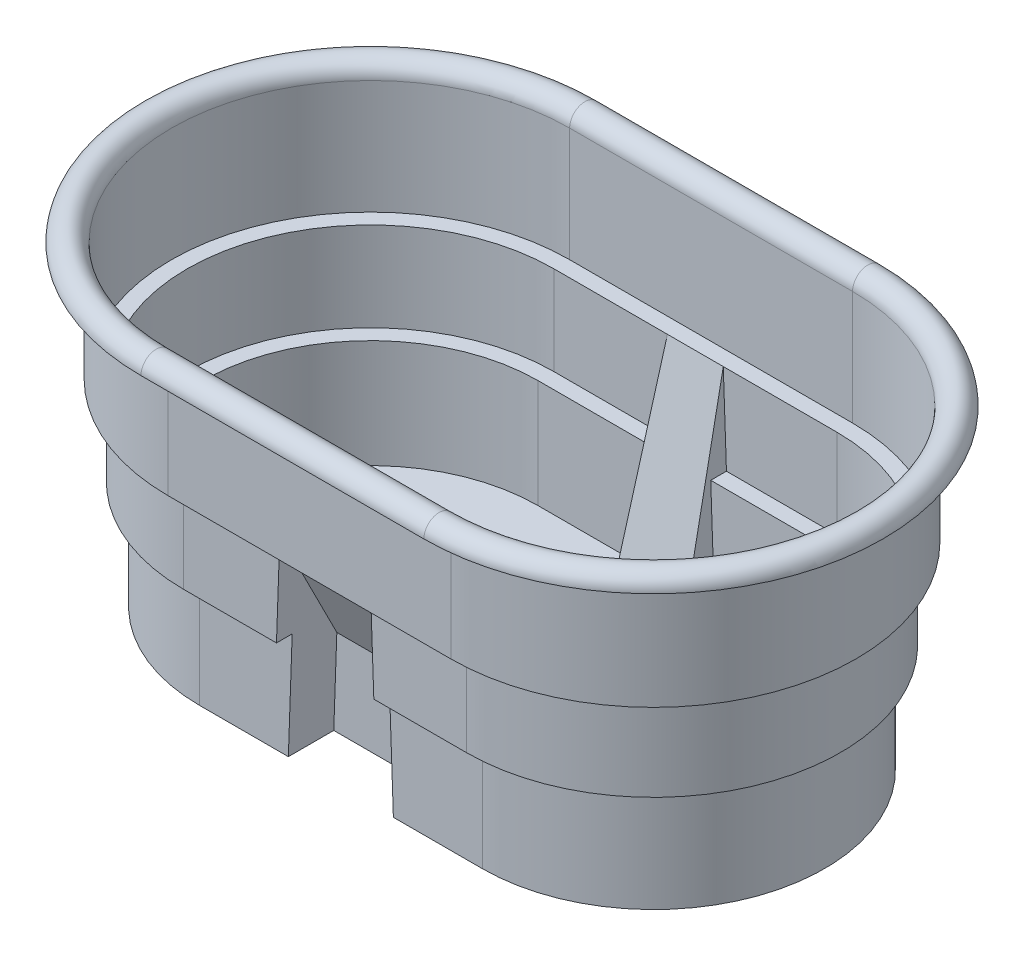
ISO-10303-21;
HEADER;
FILE_DESCRIPTION(('STEP AP214'),'2;1');
FILE_NAME('part.step','',(''),(''),'','','');
FILE_SCHEMA(('AUTOMOTIVE_DESIGN { 1 0 10303 214 1 1 1 1 }'));
ENDSEC;
DATA;
#1=APPLICATION_CONTEXT('core data for automotive mechanical design processes');
#2=APPLICATION_PROTOCOL_DEFINITION('international standard','automotive_design',2000,#1);
#3=PRODUCT_CONTEXT('',#1,'mechanical');
#4=PRODUCT('Part','Part','',(#3));
#5=PRODUCT_RELATED_PRODUCT_CATEGORY('part','',(#4));
#6=PRODUCT_DEFINITION_FORMATION('','',#4);
#7=PRODUCT_DEFINITION_CONTEXT('part definition',#1,'design');
#8=PRODUCT_DEFINITION('design','',#6,#7);
#9=PRODUCT_DEFINITION_SHAPE('','',#8);
#10=(LENGTH_UNIT() NAMED_UNIT(*) SI_UNIT(.MILLI.,.METRE.));
#11=(NAMED_UNIT(*) PLANE_ANGLE_UNIT() SI_UNIT($,.RADIAN.));
#12=(NAMED_UNIT(*) SI_UNIT($,.STERADIAN.) SOLID_ANGLE_UNIT());
#13=UNCERTAINTY_MEASURE_WITH_UNIT(LENGTH_MEASURE(1.E-05),#10,'distance_accuracy_value','');
#14=(GEOMETRIC_REPRESENTATION_CONTEXT(3) GLOBAL_UNCERTAINTY_ASSIGNED_CONTEXT((#13)) GLOBAL_UNIT_ASSIGNED_CONTEXT((#10,
#11,#12)) REPRESENTATION_CONTEXT('',''));
#15=CARTESIAN_POINT('',(0.,0.,0.));
#16=DIRECTION('',(0.,0.,1.));
#17=DIRECTION('',(1.,0.,0.));
#18=AXIS2_PLACEMENT_3D('',#15,#16,#17);
#19=CARTESIAN_POINT('',(-257.175,0.,0.));
#20=DIRECTION('',(0.,1.,0.));
#21=DIRECTION('',(0.,0.,1.));
#22=AXIS2_PLACEMENT_3D('',#19,#20,#21);
#23=CYLINDRICAL_SURFACE('',#22,304.8);
#24=CARTESIAN_POINT('',(-257.175,-593.725000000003,0.));
#25=DIRECTION('',(0.,1.,0.));
#26=DIRECTION('',(0.,0.,1.));
#27=AXIS2_PLACEMENT_3D('',#24,#25,#26);
#28=CIRCLE('',#27,304.8);
#29=CARTESIAN_POINT('',(-257.174999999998,-593.725000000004,304.8));
#30=VERTEX_POINT('',#29);
#31=CARTESIAN_POINT('',(-257.175,-593.725000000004,-304.8));
#32=VERTEX_POINT('',#31);
#33=EDGE_CURVE('E511',#30,#32,#28,.F.);
#34=ORIENTED_EDGE('',*,*,#33,.T.);
#35=DIRECTION('',(0.,1.,0.));
#36=VECTOR('',#35,1.);
#37=CARTESIAN_POINT('',(-257.175,-396.875,-304.8));
#38=LINE('',#37,#36);
#39=CARTESIAN_POINT('',(-257.175,-396.875,-304.8));
#40=VERTEX_POINT('',#39);
#41=EDGE_CURVE('E349',#32,#40,#38,.T.);
#42=ORIENTED_EDGE('',*,*,#41,.T.);
#43=CARTESIAN_POINT('',(-257.175,-396.875,0.));
#44=DIRECTION('',(0.,1.,0.));
#45=DIRECTION('',(0.,0.,1.));
#46=AXIS2_PLACEMENT_3D('',#43,#44,#45);
#47=CIRCLE('',#46,304.8);
#48=CARTESIAN_POINT('',(-257.174999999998,-396.875,304.8));
#49=VERTEX_POINT('',#48);
#50=EDGE_CURVE('E19',#40,#49,#47,.T.);
#51=ORIENTED_EDGE('',*,*,#50,.T.);
#52=DIRECTION('',(0.,-1.,0.));
#53=VECTOR('',#52,1.);
#54=CARTESIAN_POINT('',(-257.174999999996,-396.875,304.8));
#55=LINE('',#54,#53);
#56=EDGE_CURVE('E353',#49,#30,#55,.T.);
#57=ORIENTED_EDGE('',*,*,#56,.T.);
#58=EDGE_LOOP('',(#34,#42,#51,#57));
#59=FACE_BOUND('',#58,.T.);
#60=ADVANCED_FACE('F16',(#59),#23,.F.);
#61=CARTESIAN_POINT('',(257.175,-396.875,-304.8));
#62=DIRECTION('',(0.,0.,-1.));
#63=DIRECTION('',(0.,1.,0.));
#64=AXIS2_PLACEMENT_3D('',#61,#62,#63);
#65=PLANE('',#64);
#66=ORIENTED_EDGE('',*,*,#41,.F.);
#67=DIRECTION('',(1.,0.,0.));
#68=VECTOR('',#67,1.);
#69=CARTESIAN_POINT('',(0.,-593.725000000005,-304.8));
#70=LINE('',#69,#68);
#71=CARTESIAN_POINT('',(-63.4761371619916,-593.725000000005,-304.8));
#72=VERTEX_POINT('',#71);
#73=EDGE_CURVE('E405',#32,#72,#70,.T.);
#74=ORIENTED_EDGE('',*,*,#73,.T.);
#75=DIRECTION('',(0.035376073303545,0.999374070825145,0.));
#76=VECTOR('',#75,1.);
#77=CARTESIAN_POINT('',(-63.4761371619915,-593.725,-304.8));
#78=LINE('',#77,#76);
#79=CARTESIAN_POINT('',(-56.5079955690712,-396.875,-304.8));
#80=VERTEX_POINT('',#79);
#81=EDGE_CURVE('E367',#72,#80,#78,.T.);
#82=ORIENTED_EDGE('',*,*,#81,.T.);
#83=DIRECTION('',(1.,0.,0.));
#84=VECTOR('',#83,1.);
#85=CARTESIAN_POINT('',(257.175,-396.875,-304.8));
#86=LINE('',#85,#84);
#87=EDGE_CURVE('E359',#80,#40,#86,.F.);
#88=ORIENTED_EDGE('',*,*,#87,.T.);
#89=EDGE_LOOP('',(#66,#74,#82,#88));
#90=FACE_BOUND('',#89,.T.);
#91=ADVANCED_FACE('F599',(#90),#65,.F.);
#92=CARTESIAN_POINT('',(257.175,0.,0.));
#93=DIRECTION('',(0.,1.,0.));
#94=DIRECTION('',(0.,0.,1.));
#95=AXIS2_PLACEMENT_3D('',#92,#93,#94);
#96=CYLINDRICAL_SURFACE('',#95,304.8);
#97=CARTESIAN_POINT('',(257.175,-593.725000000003,0.));
#98=DIRECTION('',(0.,1.,0.));
#99=DIRECTION('',(0.,0.,1.));
#100=AXIS2_PLACEMENT_3D('',#97,#98,#99);
#101=CIRCLE('',#100,304.8);
#102=CARTESIAN_POINT('',(257.175,-593.725000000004,-304.8));
#103=VERTEX_POINT('',#102);
#104=CARTESIAN_POINT('',(257.175000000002,-593.725000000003,304.8));
#105=VERTEX_POINT('',#104);
#106=EDGE_CURVE('E373',#103,#105,#101,.F.);
#107=ORIENTED_EDGE('',*,*,#106,.T.);
#108=DIRECTION('',(0.,-1.,0.));
#109=VECTOR('',#108,1.);
#110=CARTESIAN_POINT('',(257.175000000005,-396.875,304.8));
#111=LINE('',#110,#109);
#112=CARTESIAN_POINT('',(257.175000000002,-396.875,304.8));
#113=VERTEX_POINT('',#112);
#114=EDGE_CURVE('E418',#105,#113,#111,.F.);
#115=ORIENTED_EDGE('',*,*,#114,.T.);
#116=CARTESIAN_POINT('',(257.175,-396.875,0.));
#117=DIRECTION('',(0.,1.,0.));
#118=DIRECTION('',(0.,0.,1.));
#119=AXIS2_PLACEMENT_3D('',#116,#117,#118);
#120=CIRCLE('',#119,304.8);
#121=CARTESIAN_POINT('',(257.175,-396.875,-304.8));
#122=VERTEX_POINT('',#121);
#123=EDGE_CURVE('E420',#113,#122,#120,.T.);
#124=ORIENTED_EDGE('',*,*,#123,.T.);
#125=DIRECTION('',(0.,1.,0.));
#126=VECTOR('',#125,1.);
#127=CARTESIAN_POINT('',(257.175,-396.875,-304.8));
#128=LINE('',#127,#126);
#129=EDGE_CURVE('E424',#122,#103,#128,.F.);
#130=ORIENTED_EDGE('',*,*,#129,.T.);
#131=EDGE_LOOP('',(#107,#115,#124,#130));
#132=FACE_BOUND('',#131,.T.);
#133=ADVANCED_FACE('F578',(#132),#96,.F.);
#134=CARTESIAN_POINT('',(257.175,-396.875,-304.8));
#135=DIRECTION('',(0.,0.,-1.));
#136=DIRECTION('',(0.,1.,0.));
#137=AXIS2_PLACEMENT_3D('',#134,#135,#136);
#138=PLANE('',#137);
#139=ORIENTED_EDGE('',*,*,#129,.F.);
#140=DIRECTION('',(1.,0.,0.));
#141=VECTOR('',#140,1.);
#142=CARTESIAN_POINT('',(257.175000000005,-396.875,-304.8));
#143=LINE('',#142,#141);
#144=CARTESIAN_POINT('',(56.5079955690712,-396.875,-304.8));
#145=VERTEX_POINT('',#144);
#146=EDGE_CURVE('E417',#122,#145,#143,.F.);
#147=ORIENTED_EDGE('',*,*,#146,.T.);
#148=DIRECTION('',(0.0353760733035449,-0.999374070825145,0.));
#149=VECTOR('',#148,1.);
#150=CARTESIAN_POINT('',(63.4761371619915,-593.725,-304.8));
#151=LINE('',#150,#149);
#152=CARTESIAN_POINT('',(63.4761371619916,-593.725000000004,-304.8));
#153=VERTEX_POINT('',#152);
#154=EDGE_CURVE('E422',#145,#153,#151,.T.);
#155=ORIENTED_EDGE('',*,*,#154,.T.);
#156=DIRECTION('',(1.,0.,0.));
#157=VECTOR('',#156,1.);
#158=CARTESIAN_POINT('',(0.,-593.725000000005,-304.8));
#159=LINE('',#158,#157);
#160=EDGE_CURVE('E408',#153,#103,#159,.T.);
#161=ORIENTED_EDGE('',*,*,#160,.T.);
#162=EDGE_LOOP('',(#139,#147,#155,#161));
#163=FACE_BOUND('',#162,.T.);
#164=ADVANCED_FACE('F569',(#163),#138,.F.);
#165=CARTESIAN_POINT('',(63.4761371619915,-593.725,-364.49));
#166=DIRECTION('',(-0.999374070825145,-0.0353760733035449,0.));
#167=DIRECTION('',(0.0353760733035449,-0.999374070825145,0.));
#168=AXIS2_PLACEMENT_3D('',#165,#166,#167);
#169=PLANE('',#168);
#170=DIRECTION('',(-0.035376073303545,0.999374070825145,0.));
#171=VECTOR('',#170,1.);
#172=CARTESIAN_POINT('',(56.5079955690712,-396.875,-333.375));
#173=LINE('',#172,#171);
#174=CARTESIAN_POINT('',(56.5079955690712,-396.875,-333.375));
#175=VERTEX_POINT('',#174);
#176=CARTESIAN_POINT('',(50.7761371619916,-234.95,-333.375));
#177=VERTEX_POINT('',#176);
#178=EDGE_CURVE('E509',#175,#177,#173,.T.);
#179=ORIENTED_EDGE('',*,*,#178,.T.);
#180=DIRECTION('',(-0.0344086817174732,0.972045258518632,-0.232258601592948));
#181=VECTOR('',#180,1.);
#182=CARTESIAN_POINT('',(63.4761371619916,-593.725000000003,-247.649999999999));
#183=LINE('',#182,#181);
#184=CARTESIAN_POINT('',(63.4761371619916,-593.725000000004,-247.649999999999));
#185=VERTEX_POINT('',#184);
#186=EDGE_CURVE('E412',#185,#177,#183,.T.);
#187=ORIENTED_EDGE('',*,*,#186,.F.);
#188=DIRECTION('',(0.,0.,-1.));
#189=VECTOR('',#188,1.);
#190=CARTESIAN_POINT('',(63.4761371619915,-593.725000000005,0.));
#191=LINE('',#190,#189);
#192=EDGE_CURVE('E404',#185,#153,#191,.T.);
#193=ORIENTED_EDGE('',*,*,#192,.T.);
#194=ORIENTED_EDGE('',*,*,#154,.F.);
#195=DIRECTION('',(0.,0.,-1.));
#196=VECTOR('',#195,1.);
#197=CARTESIAN_POINT('',(56.5079955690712,-396.875,333.375));
#198=LINE('',#197,#196);
#199=EDGE_CURVE('E414',#145,#175,#198,.T.);
#200=ORIENTED_EDGE('',*,*,#199,.T.);
#201=EDGE_LOOP('',(#179,#187,#193,#194,#200));
#202=FACE_BOUND('',#201,.T.);
#203=ADVANCED_FACE('F586',(#202),#169,.F.);
#204=CARTESIAN_POINT('',(-63.4761371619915,-593.725,-364.49));
#205=DIRECTION('',(0.999374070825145,-0.035376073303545,0.));
#206=DIRECTION('',(0.035376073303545,0.999374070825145,0.));
#207=AXIS2_PLACEMENT_3D('',#204,#205,#206);
#208=PLANE('',#207);
#209=DIRECTION('',(-0.0344086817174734,-0.972045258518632,0.232258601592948));
#210=VECTOR('',#209,1.);
#211=CARTESIAN_POINT('',(-50.7761371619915,-234.95,-333.375));
#212=LINE('',#211,#210);
#213=CARTESIAN_POINT('',(-50.7761371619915,-234.95,-333.375));
#214=VERTEX_POINT('',#213);
#215=CARTESIAN_POINT('',(-63.4761371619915,-593.725000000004,-247.649999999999));
#216=VERTEX_POINT('',#215);
#217=EDGE_CURVE('E401',#214,#216,#212,.T.);
#218=ORIENTED_EDGE('',*,*,#217,.F.);
#219=DIRECTION('',(-0.0353760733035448,-0.999374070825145,0.));
#220=VECTOR('',#219,1.);
#221=CARTESIAN_POINT('',(-50.7761371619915,-234.95,-333.375));
#222=LINE('',#221,#220);
#223=CARTESIAN_POINT('',(-56.5079955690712,-396.875,-333.375));
#224=VERTEX_POINT('',#223);
#225=EDGE_CURVE('E395',#214,#224,#222,.T.);
#226=ORIENTED_EDGE('',*,*,#225,.T.);
#227=DIRECTION('',(0.,0.,-1.));
#228=VECTOR('',#227,1.);
#229=CARTESIAN_POINT('',(-56.5079955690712,-396.875,-333.375));
#230=LINE('',#229,#228);
#231=EDGE_CURVE('E366',#224,#80,#230,.F.);
#232=ORIENTED_EDGE('',*,*,#231,.T.);
#233=ORIENTED_EDGE('',*,*,#81,.F.);
#234=DIRECTION('',(0.,0.,-1.));
#235=VECTOR('',#234,1.);
#236=CARTESIAN_POINT('',(-63.4761371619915,-593.725000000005,0.));
#237=LINE('',#236,#235);
#238=EDGE_CURVE('E402',#72,#216,#237,.F.);
#239=ORIENTED_EDGE('',*,*,#238,.T.);
#240=EDGE_LOOP('',(#218,#226,#232,#233,#239));
#241=FACE_BOUND('',#240,.T.);
#242=ADVANCED_FACE('F594',(#241),#208,.F.);
#243=CARTESIAN_POINT('',(-257.174999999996,-396.875,304.8));
#244=DIRECTION('',(0.,0.,1.));
#245=DIRECTION('',(0.,-1.,0.));
#246=AXIS2_PLACEMENT_3D('',#243,#244,#245);
#247=PLANE('',#246);
#248=ORIENTED_EDGE('',*,*,#56,.F.);
#249=DIRECTION('',(1.,0.,0.));
#250=VECTOR('',#249,1.);
#251=CARTESIAN_POINT('',(257.175,-396.875,304.8));
#252=LINE('',#251,#250);
#253=CARTESIAN_POINT('',(-94.6318584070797,-396.875,304.8));
#254=VERTEX_POINT('',#253);
#255=EDGE_CURVE('E358',#49,#254,#252,.T.);
#256=ORIENTED_EDGE('',*,*,#255,.T.);
#257=DIRECTION('',(0.035376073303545,0.999374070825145,0.));
#258=VECTOR('',#257,1.);
#259=CARTESIAN_POINT('',(-101.6,-593.725,304.8));
#260=LINE('',#259,#258);
#261=CARTESIAN_POINT('',(-101.6,-593.725000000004,304.8));
#262=VERTEX_POINT('',#261);
#263=EDGE_CURVE('E383',#254,#262,#260,.F.);
#264=ORIENTED_EDGE('',*,*,#263,.T.);
#265=DIRECTION('',(1.,0.,0.));
#266=VECTOR('',#265,1.);
#267=CARTESIAN_POINT('',(0.,-593.725000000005,304.8));
#268=LINE('',#267,#266);
#269=EDGE_CURVE('E364',#262,#30,#268,.F.);
#270=ORIENTED_EDGE('',*,*,#269,.T.);
#271=EDGE_LOOP('',(#248,#256,#264,#270));
#272=FACE_BOUND('',#271,.T.);
#273=ADVANCED_FACE('F361',(#272),#247,.F.);
#274=CARTESIAN_POINT('',(257.175,-396.875,-333.375));
#275=DIRECTION('',(0.,-1.,0.));
#276=DIRECTION('',(0.,0.,-1.));
#277=AXIS2_PLACEMENT_3D('',#274,#275,#276);
#278=PLANE('',#277);
#279=CARTESIAN_POINT('',(-257.175,-396.875,0.));
#280=DIRECTION('',(0.,1.,0.));
#281=DIRECTION('',(0.,0.,1.));
#282=AXIS2_PLACEMENT_3D('',#279,#280,#281);
#283=CIRCLE('',#282,333.375);
#284=CARTESIAN_POINT('',(-257.175,-396.875,-333.375));
#285=VERTEX_POINT('',#284);
#286=CARTESIAN_POINT('',(-257.174999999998,-396.875,333.375));
#287=VERTEX_POINT('',#286);
#288=EDGE_CURVE('E505',#285,#287,#283,.T.);
#289=ORIENTED_EDGE('',*,*,#288,.T.);
#290=DIRECTION('',(1.,0.,0.));
#291=VECTOR('',#290,1.);
#292=CARTESIAN_POINT('',(-257.174999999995,-396.875,333.375));
#293=LINE('',#292,#291);
#294=CARTESIAN_POINT('',(-94.6318584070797,-396.875,333.375));
#295=VERTEX_POINT('',#294);
#296=EDGE_CURVE('E381',#287,#295,#293,.T.);
#297=ORIENTED_EDGE('',*,*,#296,.T.);
#298=DIRECTION('',(0.,0.,1.));
#299=VECTOR('',#298,1.);
#300=CARTESIAN_POINT('',(-94.6318584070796,-396.875,222.22249426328));
#301=LINE('',#300,#299);
#302=EDGE_CURVE('E371',#295,#254,#301,.F.);
#303=ORIENTED_EDGE('',*,*,#302,.T.);
#304=ORIENTED_EDGE('',*,*,#255,.F.);
#305=ORIENTED_EDGE('',*,*,#50,.F.);
#306=ORIENTED_EDGE('',*,*,#87,.F.);
#307=ORIENTED_EDGE('',*,*,#231,.F.);
#308=DIRECTION('',(-1.,0.,0.));
#309=VECTOR('',#308,1.);
#310=CARTESIAN_POINT('',(257.175,-396.875,-333.375));
#311=LINE('',#310,#309);
#312=EDGE_CURVE('E392',#224,#285,#311,.T.);
#313=ORIENTED_EDGE('',*,*,#312,.T.);
#314=EDGE_LOOP('',(#289,#297,#303,#304,#305,#306,#307,#313));
#315=FACE_BOUND('',#314,.T.);
#316=ADVANCED_FACE('F369',(#315),#278,.F.);
#317=CARTESIAN_POINT('',(-101.6,-441.325,222.22249426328));
#318=DIRECTION('',(0.,0.,1.));
#319=DIRECTION('',(1.,0.,0.));
#320=AXIS2_PLACEMENT_3D('',#317,#318,#319);
#321=PLANE('',#320);
#322=DIRECTION('',(1.,0.,0.));
#323=VECTOR('',#322,1.);
#324=CARTESIAN_POINT('',(-101.6,-441.325,222.22249426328));
#325=LINE('',#324,#323);
#326=CARTESIAN_POINT('',(-96.2053097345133,-441.325,222.22249426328));
#327=VERTEX_POINT('',#326);
#328=CARTESIAN_POINT('',(96.2053097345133,-441.325,222.22249426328));
#329=VERTEX_POINT('',#328);
#330=EDGE_CURVE('E386',#327,#329,#325,.T.);
#331=ORIENTED_EDGE('',*,*,#330,.T.);
#332=DIRECTION('',(0.035376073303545,-0.999374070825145,0.));
#333=VECTOR('',#332,1.);
#334=CARTESIAN_POINT('',(101.6,-593.725,222.22249426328));
#335=LINE('',#334,#333);
#336=CARTESIAN_POINT('',(101.6,-593.725000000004,222.22249426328));
#337=VERTEX_POINT('',#336);
#338=EDGE_CURVE('E517',#329,#337,#335,.T.);
#339=ORIENTED_EDGE('',*,*,#338,.T.);
#340=DIRECTION('',(1.,0.,0.));
#341=VECTOR('',#340,1.);
#342=CARTESIAN_POINT('',(0.,-593.725000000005,222.22249426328));
#343=LINE('',#342,#341);
#344=CARTESIAN_POINT('',(-101.6,-593.725000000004,222.22249426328));
#345=VERTEX_POINT('',#344);
#346=EDGE_CURVE('E375',#337,#345,#343,.F.);
#347=ORIENTED_EDGE('',*,*,#346,.T.);
#348=DIRECTION('',(0.035376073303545,0.999374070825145,0.));
#349=VECTOR('',#348,1.);
#350=CARTESIAN_POINT('',(-101.6,-593.725,222.22249426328));
#351=LINE('',#350,#349);
#352=EDGE_CURVE('E378',#345,#327,#351,.T.);
#353=ORIENTED_EDGE('',*,*,#352,.T.);
#354=EDGE_LOOP('',(#331,#339,#347,#353));
#355=FACE_BOUND('',#354,.T.);
#356=ADVANCED_FACE('F620',(#355),#321,.F.);
#357=CARTESIAN_POINT('',(0.,-593.725000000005,0.));
#358=DIRECTION('',(0.,-1.,0.));
#359=DIRECTION('',(0.,0.,-1.));
#360=AXIS2_PLACEMENT_3D('',#357,#358,#359);
#361=PLANE('',#360);
#362=ORIENTED_EDGE('',*,*,#192,.F.);
#363=DIRECTION('',(1.,0.,0.));
#364=VECTOR('',#363,1.);
#365=CARTESIAN_POINT('',(-88.519,-593.725000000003,-247.649999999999));
#366=LINE('',#365,#364);
#367=EDGE_CURVE('E398',#216,#185,#366,.T.);
#368=ORIENTED_EDGE('',*,*,#367,.F.);
#369=ORIENTED_EDGE('',*,*,#238,.F.);
#370=ORIENTED_EDGE('',*,*,#73,.F.);
#371=ORIENTED_EDGE('',*,*,#33,.F.);
#372=ORIENTED_EDGE('',*,*,#269,.F.);
#373=DIRECTION('',(0.,0.,1.));
#374=VECTOR('',#373,1.);
#375=CARTESIAN_POINT('',(-101.6,-593.725000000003,222.22249426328));
#376=LINE('',#375,#374);
#377=EDGE_CURVE('E388',#262,#345,#376,.F.);
#378=ORIENTED_EDGE('',*,*,#377,.T.);
#379=ORIENTED_EDGE('',*,*,#346,.F.);
#380=DIRECTION('',(0.,0.,1.));
#381=VECTOR('',#380,1.);
#382=CARTESIAN_POINT('',(101.6,-593.725000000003,222.22249426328));
#383=LINE('',#382,#381);
#384=CARTESIAN_POINT('',(101.6,-593.725000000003,304.8));
#385=VERTEX_POINT('',#384);
#386=EDGE_CURVE('E518',#337,#385,#383,.T.);
#387=ORIENTED_EDGE('',*,*,#386,.T.);
#388=DIRECTION('',(1.,0.,0.));
#389=VECTOR('',#388,1.);
#390=CARTESIAN_POINT('',(-257.174999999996,-593.725000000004,304.8));
#391=LINE('',#390,#389);
#392=EDGE_CURVE('E421',#385,#105,#391,.T.);
#393=ORIENTED_EDGE('',*,*,#392,.T.);
#394=ORIENTED_EDGE('',*,*,#106,.F.);
#395=ORIENTED_EDGE('',*,*,#160,.F.);
#396=EDGE_LOOP('',(#362,#368,#369,#370,#371,#372,#378,#379,#387,#393,#394,#395));
#397=FACE_BOUND('',#396,.T.);
#398=ADVANCED_FACE('F574',(#397),#361,.F.);
#399=CARTESIAN_POINT('',(-257.174999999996,-396.875,304.8));
#400=DIRECTION('',(0.,0.,1.));
#401=DIRECTION('',(0.,-1.,0.));
#402=AXIS2_PLACEMENT_3D('',#399,#400,#401);
#403=PLANE('',#402);
#404=ORIENTED_EDGE('',*,*,#114,.F.);
#405=ORIENTED_EDGE('',*,*,#392,.F.);
#406=DIRECTION('',(0.035376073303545,-0.999374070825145,0.));
#407=VECTOR('',#406,1.);
#408=CARTESIAN_POINT('',(101.6,-593.725,304.8));
#409=LINE('',#408,#407);
#410=CARTESIAN_POINT('',(94.6318584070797,-396.875,304.8));
#411=VERTEX_POINT('',#410);
#412=EDGE_CURVE('E560',#385,#411,#409,.F.);
#413=ORIENTED_EDGE('',*,*,#412,.T.);
#414=DIRECTION('',(1.,0.,0.));
#415=VECTOR('',#414,1.);
#416=CARTESIAN_POINT('',(257.175000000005,-396.875,304.8));
#417=LINE('',#416,#415);
#418=EDGE_CURVE('E416',#411,#113,#417,.T.);
#419=ORIENTED_EDGE('',*,*,#418,.T.);
#420=EDGE_LOOP('',(#404,#405,#413,#419));
#421=FACE_BOUND('',#420,.T.);
#422=ADVANCED_FACE('F628',(#421),#403,.F.);
#423=CARTESIAN_POINT('',(257.175000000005,-396.875,333.375));
#424=DIRECTION('',(0.,-1.,0.));
#425=DIRECTION('',(0.,0.,-1.));
#426=AXIS2_PLACEMENT_3D('',#423,#424,#425);
#427=PLANE('',#426);
#428=DIRECTION('',(0.,0.,1.));
#429=VECTOR('',#428,1.);
#430=CARTESIAN_POINT('',(94.6318584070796,-396.875,222.22249426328));
#431=LINE('',#430,#429);
#432=CARTESIAN_POINT('',(94.6318584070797,-396.875,333.375));
#433=VERTEX_POINT('',#432);
#434=EDGE_CURVE('E558',#411,#433,#431,.T.);
#435=ORIENTED_EDGE('',*,*,#434,.T.);
#436=DIRECTION('',(1.,0.,0.));
#437=VECTOR('',#436,1.);
#438=CARTESIAN_POINT('',(-257.174999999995,-396.875,333.375));
#439=LINE('',#438,#437);
#440=CARTESIAN_POINT('',(257.175000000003,-396.875,333.375));
#441=VERTEX_POINT('',#440);
#442=EDGE_CURVE('E552',#433,#441,#439,.T.);
#443=ORIENTED_EDGE('',*,*,#442,.T.);
#444=CARTESIAN_POINT('',(257.175,-396.875,0.));
#445=DIRECTION('',(0.,1.,0.));
#446=DIRECTION('',(0.,0.,1.));
#447=AXIS2_PLACEMENT_3D('',#444,#445,#446);
#448=CIRCLE('',#447,333.375);
#449=CARTESIAN_POINT('',(257.175,-396.875,-333.375));
#450=VERTEX_POINT('',#449);
#451=EDGE_CURVE('E507',#441,#450,#448,.T.);
#452=ORIENTED_EDGE('',*,*,#451,.T.);
#453=DIRECTION('',(-1.,0.,0.));
#454=VECTOR('',#453,1.);
#455=CARTESIAN_POINT('',(257.175,-396.875,-333.375));
#456=LINE('',#455,#454);
#457=EDGE_CURVE('E409',#450,#175,#456,.T.);
#458=ORIENTED_EDGE('',*,*,#457,.T.);
#459=ORIENTED_EDGE('',*,*,#199,.F.);
#460=ORIENTED_EDGE('',*,*,#146,.F.);
#461=ORIENTED_EDGE('',*,*,#123,.F.);
#462=ORIENTED_EDGE('',*,*,#418,.F.);
#463=EDGE_LOOP('',(#435,#443,#452,#458,#459,#460,#461,#462));
#464=FACE_BOUND('',#463,.T.);
#465=ADVANCED_FACE('F582',(#464),#427,.F.);
#466=CARTESIAN_POINT('',(257.175,0.,0.));
#467=DIRECTION('',(0.,1.,0.));
#468=DIRECTION('',(0.,0.,1.));
#469=AXIS2_PLACEMENT_3D('',#466,#467,#468);
#470=CYLINDRICAL_SURFACE('',#469,333.375);
#471=DIRECTION('',(0.,1.,0.));
#472=VECTOR('',#471,1.);
#473=CARTESIAN_POINT('',(257.175000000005,-234.95,333.375));
#474=LINE('',#473,#472);
#475=CARTESIAN_POINT('',(257.175000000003,-234.95,333.375));
#476=VERTEX_POINT('',#475);
#477=EDGE_CURVE('E504',#441,#476,#474,.T.);
#478=ORIENTED_EDGE('',*,*,#477,.T.);
#479=CARTESIAN_POINT('',(257.175,-234.95,0.));
#480=DIRECTION('',(0.,1.,0.));
#481=DIRECTION('',(0.,0.,1.));
#482=AXIS2_PLACEMENT_3D('',#479,#480,#481);
#483=CIRCLE('',#482,333.375);
#484=CARTESIAN_POINT('',(257.175,-234.95,-333.375));
#485=VERTEX_POINT('',#484);
#486=EDGE_CURVE('E501',#476,#485,#483,.T.);
#487=ORIENTED_EDGE('',*,*,#486,.T.);
#488=DIRECTION('',(0.,1.,0.));
#489=VECTOR('',#488,1.);
#490=CARTESIAN_POINT('',(257.175,-234.95,-333.375));
#491=LINE('',#490,#489);
#492=EDGE_CURVE('E413',#485,#450,#491,.F.);
#493=ORIENTED_EDGE('',*,*,#492,.T.);
#494=ORIENTED_EDGE('',*,*,#451,.F.);
#495=EDGE_LOOP('',(#478,#487,#493,#494));
#496=FACE_BOUND('',#495,.T.);
#497=ADVANCED_FACE('F636',(#496),#470,.F.);
#498=CARTESIAN_POINT('',(257.175,-234.95,-333.375));
#499=DIRECTION('',(0.,0.,-1.));
#500=DIRECTION('',(-1.,0.,0.));
#501=AXIS2_PLACEMENT_3D('',#498,#499,#500);
#502=PLANE('',#501);
#503=ORIENTED_EDGE('',*,*,#492,.F.);
#504=DIRECTION('',(1.,0.,0.));
#505=VECTOR('',#504,1.);
#506=CARTESIAN_POINT('',(50.7761371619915,-234.95,-333.375));
#507=LINE('',#506,#505);
#508=EDGE_CURVE('E503',#485,#177,#507,.F.);
#509=ORIENTED_EDGE('',*,*,#508,.T.);
#510=ORIENTED_EDGE('',*,*,#178,.F.);
#511=ORIENTED_EDGE('',*,*,#457,.F.);
#512=EDGE_LOOP('',(#503,#509,#510,#511));
#513=FACE_BOUND('',#512,.T.);
#514=ADVANCED_FACE('F868',(#513),#502,.F.);
#515=CARTESIAN_POINT('',(-88.519,-234.95,-333.375));
#516=DIRECTION('',(0.,0.232396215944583,0.972621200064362));
#517=DIRECTION('',(0.,-0.972621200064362,0.232396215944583));
#518=AXIS2_PLACEMENT_3D('',#515,#516,#517);
#519=PLANE('',#518);
#520=ORIENTED_EDGE('',*,*,#217,.T.);
#521=ORIENTED_EDGE('',*,*,#367,.T.);
#522=ORIENTED_EDGE('',*,*,#186,.T.);
#523=DIRECTION('',(1.,0.,0.));
#524=VECTOR('',#523,1.);
#525=CARTESIAN_POINT('',(50.7761371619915,-234.95,-333.375));
#526=LINE('',#525,#524);
#527=EDGE_CURVE('E542',#177,#214,#526,.F.);
#528=ORIENTED_EDGE('',*,*,#527,.T.);
#529=EDGE_LOOP('',(#520,#521,#522,#528));
#530=FACE_BOUND('',#529,.T.);
#531=ADVANCED_FACE('F590',(#530),#519,.T.);
#532=CARTESIAN_POINT('',(257.175,-234.95,-333.375));
#533=DIRECTION('',(0.,0.,-1.));
#534=DIRECTION('',(-1.,0.,0.));
#535=AXIS2_PLACEMENT_3D('',#532,#533,#534);
#536=PLANE('',#535);
#537=DIRECTION('',(0.,1.,0.));
#538=VECTOR('',#537,1.);
#539=CARTESIAN_POINT('',(-257.175,0.,-333.375));
#540=LINE('',#539,#538);
#541=CARTESIAN_POINT('',(-257.175,-234.95,-333.375));
#542=VERTEX_POINT('',#541);
#543=EDGE_CURVE('E394',#542,#285,#540,.F.);
#544=ORIENTED_EDGE('',*,*,#543,.T.);
#545=ORIENTED_EDGE('',*,*,#312,.F.);
#546=ORIENTED_EDGE('',*,*,#225,.F.);
#547=DIRECTION('',(1.,0.,0.));
#548=VECTOR('',#547,1.);
#549=CARTESIAN_POINT('',(50.7761371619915,-234.95,-333.375));
#550=LINE('',#549,#548);
#551=EDGE_CURVE('E500',#214,#542,#550,.F.);
#552=ORIENTED_EDGE('',*,*,#551,.T.);
#553=EDGE_LOOP('',(#544,#545,#546,#552));
#554=FACE_BOUND('',#553,.T.);
#555=ADVANCED_FACE('F602',(#554),#536,.F.);
#556=CARTESIAN_POINT('',(-257.175,0.,0.));
#557=DIRECTION('',(0.,1.,0.));
#558=DIRECTION('',(0.,0.,1.));
#559=AXIS2_PLACEMENT_3D('',#556,#557,#558);
#560=CYLINDRICAL_SURFACE('',#559,333.375);
#561=ORIENTED_EDGE('',*,*,#288,.F.);
#562=ORIENTED_EDGE('',*,*,#543,.F.);
#563=CARTESIAN_POINT('',(-257.175,-234.95,0.));
#564=DIRECTION('',(0.,1.,0.));
#565=DIRECTION('',(0.,0.,1.));
#566=AXIS2_PLACEMENT_3D('',#563,#564,#565);
#567=CIRCLE('',#566,333.375);
#568=CARTESIAN_POINT('',(-257.174999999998,-234.95,333.375));
#569=VERTEX_POINT('',#568);
#570=EDGE_CURVE('E497',#542,#569,#567,.T.);
#571=ORIENTED_EDGE('',*,*,#570,.T.);
#572=DIRECTION('',(0.,1.,0.));
#573=VECTOR('',#572,1.);
#574=CARTESIAN_POINT('',(-257.174999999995,-234.95,333.375));
#575=LINE('',#574,#573);
#576=EDGE_CURVE('E384',#569,#287,#575,.F.);
#577=ORIENTED_EDGE('',*,*,#576,.T.);
#578=EDGE_LOOP('',(#561,#562,#571,#577));
#579=FACE_BOUND('',#578,.T.);
#580=ADVANCED_FACE('F608',(#579),#560,.F.);
#581=CARTESIAN_POINT('',(-257.174999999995,-234.95,333.375));
#582=DIRECTION('',(0.,0.,1.));
#583=DIRECTION('',(1.,0.,0.));
#584=AXIS2_PLACEMENT_3D('',#581,#582,#583);
#585=PLANE('',#584);
#586=ORIENTED_EDGE('',*,*,#576,.F.);
#587=DIRECTION('',(1.,0.,0.));
#588=VECTOR('',#587,1.);
#589=CARTESIAN_POINT('',(50.7761371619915,-234.95,333.375));
#590=LINE('',#589,#588);
#591=CARTESIAN_POINT('',(-88.9,-234.95,333.375));
#592=VERTEX_POINT('',#591);
#593=EDGE_CURVE('E499',#569,#592,#590,.T.);
#594=ORIENTED_EDGE('',*,*,#593,.T.);
#595=DIRECTION('',(0.035376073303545,0.999374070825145,0.));
#596=VECTOR('',#595,1.);
#597=CARTESIAN_POINT('',(-101.6,-593.725,333.375));
#598=LINE('',#597,#596);
#599=EDGE_CURVE('E387',#592,#295,#598,.F.);
#600=ORIENTED_EDGE('',*,*,#599,.T.);
#601=ORIENTED_EDGE('',*,*,#296,.F.);
#602=EDGE_LOOP('',(#586,#594,#600,#601));
#603=FACE_BOUND('',#602,.T.);
#604=ADVANCED_FACE('F613',(#603),#585,.F.);
#605=CARTESIAN_POINT('',(-101.6,-593.725,222.22249426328));
#606=DIRECTION('',(0.999374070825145,-0.035376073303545,0.));
#607=DIRECTION('',(0.035376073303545,0.999374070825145,0.));
#608=AXIS2_PLACEMENT_3D('',#605,#606,#607);
#609=PLANE('',#608);
#610=ORIENTED_EDGE('',*,*,#599,.F.);
#611=DIRECTION('',(0.,0.,-1.));
#612=VECTOR('',#611,1.);
#613=CARTESIAN_POINT('',(-88.9,-234.95,-364.49));
#614=LINE('',#613,#612);
#615=CARTESIAN_POINT('',(-88.9,-234.95,330.310860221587));
#616=VERTEX_POINT('',#615);
#617=EDGE_CURVE('E533',#592,#616,#614,.T.);
#618=ORIENTED_EDGE('',*,*,#617,.T.);
#619=DIRECTION('',(-0.0313422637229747,-0.885418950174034,-0.463735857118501));
#620=VECTOR('',#619,1.);
#621=CARTESIAN_POINT('',(-88.9,-234.95,330.310860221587));
#622=LINE('',#621,#620);
#623=EDGE_CURVE('E520',#616,#327,#622,.T.);
#624=ORIENTED_EDGE('',*,*,#623,.T.);
#625=ORIENTED_EDGE('',*,*,#352,.F.);
#626=ORIENTED_EDGE('',*,*,#377,.F.);
#627=ORIENTED_EDGE('',*,*,#263,.F.);
#628=ORIENTED_EDGE('',*,*,#302,.F.);
#629=EDGE_LOOP('',(#610,#618,#624,#625,#626,#627,#628));
#630=FACE_BOUND('',#629,.T.);
#631=ADVANCED_FACE('F616',(#630),#609,.F.);
#632=CARTESIAN_POINT('',(-101.6,-234.95,330.310860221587));
#633=DIRECTION('',(0.,-0.463963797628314,0.885854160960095));
#634=DIRECTION('',(0.,-0.885854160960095,-0.463963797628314));
#635=AXIS2_PLACEMENT_3D('',#632,#633,#634);
#636=PLANE('',#635);
#637=DIRECTION('',(1.,0.,0.));
#638=VECTOR('',#637,1.);
#639=CARTESIAN_POINT('',(50.7761371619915,-234.95,330.310860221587));
#640=LINE('',#639,#638);
#641=CARTESIAN_POINT('',(88.9,-234.95,330.310860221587));
#642=VERTEX_POINT('',#641);
#643=EDGE_CURVE('E532',#616,#642,#640,.T.);
#644=ORIENTED_EDGE('',*,*,#643,.T.);
#645=DIRECTION('',(0.0313422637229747,-0.885418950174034,-0.4637358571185));
#646=VECTOR('',#645,1.);
#647=CARTESIAN_POINT('',(88.9,-234.95,330.310860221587));
#648=LINE('',#647,#646);
#649=EDGE_CURVE('E519',#642,#329,#648,.T.);
#650=ORIENTED_EDGE('',*,*,#649,.T.);
#651=ORIENTED_EDGE('',*,*,#330,.F.);
#652=ORIENTED_EDGE('',*,*,#623,.F.);
#653=EDGE_LOOP('',(#644,#650,#651,#652));
#654=FACE_BOUND('',#653,.T.);
#655=ADVANCED_FACE('F854',(#654),#636,.F.);
#656=CARTESIAN_POINT('',(101.6,-593.725,222.22249426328));
#657=DIRECTION('',(-0.999374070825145,-0.035376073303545,0.));
#658=DIRECTION('',(0.035376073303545,-0.999374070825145,0.));
#659=AXIS2_PLACEMENT_3D('',#656,#657,#658);
#660=PLANE('',#659);
#661=ORIENTED_EDGE('',*,*,#412,.F.);
#662=ORIENTED_EDGE('',*,*,#386,.F.);
#663=ORIENTED_EDGE('',*,*,#338,.F.);
#664=ORIENTED_EDGE('',*,*,#649,.F.);
#665=DIRECTION('',(0.,0.,-1.));
#666=VECTOR('',#665,1.);
#667=CARTESIAN_POINT('',(88.9,-234.95,-364.49));
#668=LINE('',#667,#666);
#669=CARTESIAN_POINT('',(88.9,-234.95,333.375));
#670=VERTEX_POINT('',#669);
#671=EDGE_CURVE('E888',#642,#670,#668,.F.);
#672=ORIENTED_EDGE('',*,*,#671,.T.);
#673=DIRECTION('',(0.0353760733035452,-0.999374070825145,0.));
#674=VECTOR('',#673,1.);
#675=CARTESIAN_POINT('',(88.9,-234.95,333.375));
#676=LINE('',#675,#674);
#677=EDGE_CURVE('E554',#670,#433,#676,.T.);
#678=ORIENTED_EDGE('',*,*,#677,.T.);
#679=ORIENTED_EDGE('',*,*,#434,.F.);
#680=EDGE_LOOP('',(#661,#662,#663,#664,#672,#678,#679));
#681=FACE_BOUND('',#680,.T.);
#682=ADVANCED_FACE('F625',(#681),#660,.F.);
#683=CARTESIAN_POINT('',(-257.174999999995,-234.95,333.375));
#684=DIRECTION('',(0.,0.,1.));
#685=DIRECTION('',(1.,0.,0.));
#686=AXIS2_PLACEMENT_3D('',#683,#684,#685);
#687=PLANE('',#686);
#688=ORIENTED_EDGE('',*,*,#477,.F.);
#689=ORIENTED_EDGE('',*,*,#442,.F.);
#690=ORIENTED_EDGE('',*,*,#677,.F.);
#691=DIRECTION('',(1.,0.,0.));
#692=VECTOR('',#691,1.);
#693=CARTESIAN_POINT('',(50.7761371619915,-234.95,333.375));
#694=LINE('',#693,#692);
#695=EDGE_CURVE('E885',#670,#476,#694,.T.);
#696=ORIENTED_EDGE('',*,*,#695,.T.);
#697=EDGE_LOOP('',(#688,#689,#690,#696));
#698=FACE_BOUND('',#697,.T.);
#699=ADVANCED_FACE('F847',(#698),#687,.F.);
#700=CARTESIAN_POINT('',(50.7761371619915,-234.95,-364.49));
#701=DIRECTION('',(0.,-1.,0.));
#702=DIRECTION('',(0.,0.,-1.));
#703=AXIS2_PLACEMENT_3D('',#700,#701,#702);
#704=PLANE('',#703);
#705=DIRECTION('',(1.,0.,0.));
#706=VECTOR('',#705,1.);
#707=CARTESIAN_POINT('',(-257.174999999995,-234.95,361.95));
#708=LINE('',#707,#706);
#709=CARTESIAN_POINT('',(-257.175,-234.95,361.95));
#710=VERTEX_POINT('',#709);
#711=CARTESIAN_POINT('',(257.175,-234.95,361.95));
#712=VERTEX_POINT('',#711);
#713=EDGE_CURVE('E496',#710,#712,#708,.T.);
#714=ORIENTED_EDGE('',*,*,#713,.T.);
#715=CARTESIAN_POINT('',(257.175,-234.95,0.));
#716=DIRECTION('',(0.,1.,0.));
#717=DIRECTION('',(0.,0.,1.));
#718=AXIS2_PLACEMENT_3D('',#715,#716,#717);
#719=CIRCLE('',#718,361.95);
#720=CARTESIAN_POINT('',(257.175,-234.95,-361.95));
#721=VERTEX_POINT('',#720);
#722=EDGE_CURVE('E489',#712,#721,#719,.T.);
#723=ORIENTED_EDGE('',*,*,#722,.T.);
#724=DIRECTION('',(-1.,0.,0.));
#725=VECTOR('',#724,1.);
#726=CARTESIAN_POINT('',(257.175,-234.95,-361.95));
#727=LINE('',#726,#725);
#728=CARTESIAN_POINT('',(-257.175,-234.95,-361.95));
#729=VERTEX_POINT('',#728);
#730=EDGE_CURVE('E901',#721,#729,#727,.T.);
#731=ORIENTED_EDGE('',*,*,#730,.T.);
#732=CARTESIAN_POINT('',(-257.175,-234.95,0.));
#733=DIRECTION('',(0.,1.,0.));
#734=DIRECTION('',(0.,0.,1.));
#735=AXIS2_PLACEMENT_3D('',#732,#733,#734);
#736=CIRCLE('',#735,361.95);
#737=EDGE_CURVE('E493',#729,#710,#736,.T.);
#738=ORIENTED_EDGE('',*,*,#737,.T.);
#739=EDGE_LOOP('',(#714,#723,#731,#738));
#740=FACE_BOUND('',#739,.T.);
#741=ORIENTED_EDGE('',*,*,#671,.F.);
#742=ORIENTED_EDGE('',*,*,#643,.F.);
#743=ORIENTED_EDGE('',*,*,#617,.F.);
#744=ORIENTED_EDGE('',*,*,#593,.F.);
#745=ORIENTED_EDGE('',*,*,#570,.F.);
#746=ORIENTED_EDGE('',*,*,#551,.F.);
#747=ORIENTED_EDGE('',*,*,#527,.F.);
#748=ORIENTED_EDGE('',*,*,#508,.F.);
#749=ORIENTED_EDGE('',*,*,#486,.F.);
#750=ORIENTED_EDGE('',*,*,#695,.F.);
#751=EDGE_LOOP('',(#741,#742,#743,#744,#745,#746,#747,#748,#749,#750));
#752=FACE_BOUND('',#751,.T.);
#753=ADVANCED_FACE('F843',(#740,#752),#704,.F.);
#754=CARTESIAN_POINT('',(-257.174999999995,-27.746284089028,361.95));
#755=DIRECTION('',(0.,0.,1.));
#756=DIRECTION('',(1.,0.,0.));
#757=AXIS2_PLACEMENT_3D('',#754,#755,#756);
#758=PLANE('',#757);
#759=ORIENTED_EDGE('',*,*,#713,.F.);
#760=DIRECTION('',(0.,1.,0.));
#761=VECTOR('',#760,1.);
#762=CARTESIAN_POINT('',(-257.175,0.,361.95));
#763=LINE('',#762,#761);
#764=CARTESIAN_POINT('',(-257.174999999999,-27.746284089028,361.95));
#765=VERTEX_POINT('',#764);
#766=EDGE_CURVE('E495',#710,#765,#763,.T.);
#767=ORIENTED_EDGE('',*,*,#766,.T.);
#768=DIRECTION('',(1.,0.,0.));
#769=VECTOR('',#768,1.);
#770=CARTESIAN_POINT('',(-257.174999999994,-27.746284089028,361.95));
#771=LINE('',#770,#769);
#772=CARTESIAN_POINT('',(257.175,-27.746284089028,361.95));
#773=VERTEX_POINT('',#772);
#774=EDGE_CURVE('E910',#773,#765,#771,.F.);
#775=ORIENTED_EDGE('',*,*,#774,.F.);
#776=DIRECTION('',(0.,1.,0.));
#777=VECTOR('',#776,1.);
#778=CARTESIAN_POINT('',(257.175,0.,361.95));
#779=LINE('',#778,#777);
#780=EDGE_CURVE('E492',#773,#712,#779,.F.);
#781=ORIENTED_EDGE('',*,*,#780,.T.);
#782=EDGE_LOOP('',(#759,#767,#775,#781));
#783=FACE_BOUND('',#782,.T.);
#784=ADVANCED_FACE('F839',(#783),#758,.F.);
#785=CARTESIAN_POINT('',(-257.175,0.,0.));
#786=DIRECTION('',(0.,1.,0.));
#787=DIRECTION('',(0.,0.,1.));
#788=AXIS2_PLACEMENT_3D('',#785,#786,#787);
#789=CYLINDRICAL_SURFACE('',#788,361.95);
#790=ORIENTED_EDGE('',*,*,#737,.F.);
#791=DIRECTION('',(0.,1.,0.));
#792=VECTOR('',#791,1.);
#793=CARTESIAN_POINT('',(-257.175,-27.746284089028,-361.95));
#794=LINE('',#793,#792);
#795=CARTESIAN_POINT('',(-257.175,-27.746284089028,-361.95));
#796=VERTEX_POINT('',#795);
#797=EDGE_CURVE('E903',#729,#796,#794,.T.);
#798=ORIENTED_EDGE('',*,*,#797,.T.);
#799=CARTESIAN_POINT('',(-257.175,-27.746284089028,0.));
#800=DIRECTION('',(0.,1.,0.));
#801=DIRECTION('',(0.,0.,1.));
#802=AXIS2_PLACEMENT_3D('',#799,#800,#801);
#803=CIRCLE('',#802,361.95);
#804=EDGE_CURVE('E815',#765,#796,#803,.F.);
#805=ORIENTED_EDGE('',*,*,#804,.F.);
#806=ORIENTED_EDGE('',*,*,#766,.F.);
#807=EDGE_LOOP('',(#790,#798,#805,#806));
#808=FACE_BOUND('',#807,.T.);
#809=ADVANCED_FACE('F835',(#808),#789,.F.);
#810=CARTESIAN_POINT('',(257.175,-27.746284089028,-361.95));
#811=DIRECTION('',(0.,0.,-1.));
#812=DIRECTION('',(-1.,0.,0.));
#813=AXIS2_PLACEMENT_3D('',#810,#811,#812);
#814=PLANE('',#813);
#815=ORIENTED_EDGE('',*,*,#730,.F.);
#816=DIRECTION('',(0.,1.,0.));
#817=VECTOR('',#816,1.);
#818=CARTESIAN_POINT('',(257.175,0.,-361.95));
#819=LINE('',#818,#817);
#820=CARTESIAN_POINT('',(257.175,-27.746284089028,-361.95));
#821=VERTEX_POINT('',#820);
#822=EDGE_CURVE('E491',#721,#821,#819,.T.);
#823=ORIENTED_EDGE('',*,*,#822,.T.);
#824=DIRECTION('',(-1.,0.,0.));
#825=VECTOR('',#824,1.);
#826=CARTESIAN_POINT('',(257.175,-27.746284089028,-361.95));
#827=LINE('',#826,#825);
#828=EDGE_CURVE('E808',#796,#821,#827,.F.);
#829=ORIENTED_EDGE('',*,*,#828,.F.);
#830=ORIENTED_EDGE('',*,*,#797,.F.);
#831=EDGE_LOOP('',(#815,#823,#829,#830));
#832=FACE_BOUND('',#831,.T.);
#833=ADVANCED_FACE('F831',(#832),#814,.F.);
#834=CARTESIAN_POINT('',(257.175,0.,0.));
#835=DIRECTION('',(0.,1.,0.));
#836=DIRECTION('',(0.,0.,1.));
#837=AXIS2_PLACEMENT_3D('',#834,#835,#836);
#838=CYLINDRICAL_SURFACE('',#837,361.95);
#839=ORIENTED_EDGE('',*,*,#722,.F.);
#840=ORIENTED_EDGE('',*,*,#780,.F.);
#841=CARTESIAN_POINT('',(257.175,-27.746284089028,1.11022302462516E-13));
#842=DIRECTION('',(0.,1.,0.));
#843=DIRECTION('',(0.,0.,1.));
#844=AXIS2_PLACEMENT_3D('',#841,#842,#843);
#845=CIRCLE('',#844,361.95);
#846=EDGE_CURVE('E811',#821,#773,#845,.F.);
#847=ORIENTED_EDGE('',*,*,#846,.F.);
#848=ORIENTED_EDGE('',*,*,#822,.F.);
#849=EDGE_LOOP('',(#839,#840,#847,#848));
#850=FACE_BOUND('',#849,.T.);
#851=ADVANCED_FACE('F827',(#850),#838,.F.);
#852=CARTESIAN_POINT('',(-257.174999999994,-27.746284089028,389.696284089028));
#853=DIRECTION('',(1.,0.,0.));
#854=DIRECTION('',(0.,0.,-1.));
#855=AXIS2_PLACEMENT_3D('',#852,#853,#854);
#856=CYLINDRICAL_SURFACE('',#855,27.746284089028);
#857=CARTESIAN_POINT('',(-257.175,-27.746284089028,389.696284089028));
#858=DIRECTION('',(1.,0.,0.));
#859=DIRECTION('',(0.,0.,1.));
#860=AXIS2_PLACEMENT_3D('',#857,#858,#859);
#861=CIRCLE('',#860,27.746284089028);
#862=CARTESIAN_POINT('',(-257.175,-27.746284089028,417.442568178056));
#863=VERTEX_POINT('',#862);
#864=EDGE_CURVE('E818',#863,#765,#861,.F.);
#865=ORIENTED_EDGE('',*,*,#864,.F.);
#866=DIRECTION('',(1.,0.,0.));
#867=VECTOR('',#866,1.);
#868=CARTESIAN_POINT('',(5.99520433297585E-12,-27.746284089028,417.442568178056));
#869=LINE('',#868,#867);
#870=CARTESIAN_POINT('',(257.175,-27.746284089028,417.442568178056));
#871=VERTEX_POINT('',#870);
#872=EDGE_CURVE('E488',#871,#863,#869,.F.);
#873=ORIENTED_EDGE('',*,*,#872,.F.);
#874=CARTESIAN_POINT('',(257.175,-27.746284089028,389.696284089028));
#875=DIRECTION('',(1.,0.,0.));
#876=DIRECTION('',(0.,0.,1.));
#877=AXIS2_PLACEMENT_3D('',#874,#875,#876);
#878=CIRCLE('',#877,27.746284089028);
#879=EDGE_CURVE('E804',#773,#871,#878,.T.);
#880=ORIENTED_EDGE('',*,*,#879,.F.);
#881=ORIENTED_EDGE('',*,*,#774,.T.);
#882=EDGE_LOOP('',(#865,#873,#880,#881));
#883=FACE_BOUND('',#882,.T.);
#884=ADVANCED_FACE('F823',(#883),#856,.T.);
#885=CARTESIAN_POINT('',(-257.175,-27.746284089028,0.));
#886=DIRECTION('',(0.,1.,0.));
#887=DIRECTION('',(0.,0.,1.));
#888=AXIS2_PLACEMENT_3D('',#885,#886,#887);
#889=TOROIDAL_SURFACE('',#888,389.696284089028,27.746284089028);
#890=CARTESIAN_POINT('',(-257.175,-27.746284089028,-389.696284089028));
#891=DIRECTION('',(-1.,0.,0.));
#892=DIRECTION('',(0.,0.,1.));
#893=AXIS2_PLACEMENT_3D('',#890,#891,#892);
#894=CIRCLE('',#893,27.746284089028);
#895=CARTESIAN_POINT('',(-257.175,-27.746284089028,-417.442568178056));
#896=VERTEX_POINT('',#895);
#897=EDGE_CURVE('E812',#896,#796,#894,.F.);
#898=ORIENTED_EDGE('',*,*,#897,.F.);
#899=CARTESIAN_POINT('',(-257.175,-27.746284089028,0.));
#900=DIRECTION('',(0.,1.,0.));
#901=DIRECTION('',(0.,0.,1.));
#902=AXIS2_PLACEMENT_3D('',#899,#900,#901);
#903=CIRCLE('',#902,417.442568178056);
#904=EDGE_CURVE('E485',#863,#896,#903,.F.);
#905=ORIENTED_EDGE('',*,*,#904,.F.);
#906=ORIENTED_EDGE('',*,*,#864,.T.);
#907=ORIENTED_EDGE('',*,*,#804,.T.);
#908=EDGE_LOOP('',(#898,#905,#906,#907));
#909=FACE_BOUND('',#908,.T.);
#910=ADVANCED_FACE('F820',(#909),#889,.T.);
#911=CARTESIAN_POINT('',(257.175,-27.746284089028,-389.696284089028));
#912=DIRECTION('',(-1.,0.,0.));
#913=DIRECTION('',(0.,0.,1.));
#914=AXIS2_PLACEMENT_3D('',#911,#912,#913);
#915=CYLINDRICAL_SURFACE('',#914,27.746284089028);
#916=CARTESIAN_POINT('',(257.175,-27.746284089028,-389.696284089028));
#917=DIRECTION('',(-1.,0.,0.));
#918=DIRECTION('',(0.,0.,-1.));
#919=AXIS2_PLACEMENT_3D('',#916,#917,#918);
#920=CIRCLE('',#919,27.746284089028);
#921=CARTESIAN_POINT('',(257.175,-27.746284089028,-417.442568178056));
#922=VERTEX_POINT('',#921);
#923=EDGE_CURVE('E807',#922,#821,#920,.F.);
#924=ORIENTED_EDGE('',*,*,#923,.F.);
#925=DIRECTION('',(1.,0.,0.));
#926=VECTOR('',#925,1.);
#927=CARTESIAN_POINT('',(5.99520433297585E-12,-27.746284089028,-417.442568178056));
#928=LINE('',#927,#926);
#929=EDGE_CURVE('E484',#896,#922,#928,.T.);
#930=ORIENTED_EDGE('',*,*,#929,.F.);
#931=ORIENTED_EDGE('',*,*,#897,.T.);
#932=ORIENTED_EDGE('',*,*,#828,.T.);
#933=EDGE_LOOP('',(#924,#930,#931,#932));
#934=FACE_BOUND('',#933,.T.);
#935=ADVANCED_FACE('F797',(#934),#915,.T.);
#936=CARTESIAN_POINT('',(257.175,-27.746284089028,1.11022302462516E-13));
#937=DIRECTION('',(0.,1.,0.));
#938=DIRECTION('',(0.,0.,1.));
#939=AXIS2_PLACEMENT_3D('',#936,#937,#938);
#940=TOROIDAL_SURFACE('',#939,389.696284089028,27.746284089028);
#941=ORIENTED_EDGE('',*,*,#923,.T.);
#942=ORIENTED_EDGE('',*,*,#846,.T.);
#943=ORIENTED_EDGE('',*,*,#879,.T.);
#944=CARTESIAN_POINT('',(257.175,-27.746284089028,1.11022302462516E-13));
#945=DIRECTION('',(0.,1.,0.));
#946=DIRECTION('',(0.,0.,1.));
#947=AXIS2_PLACEMENT_3D('',#944,#945,#946);
#948=CIRCLE('',#947,417.442568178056);
#949=EDGE_CURVE('E481',#922,#871,#948,.F.);
#950=ORIENTED_EDGE('',*,*,#949,.F.);
#951=EDGE_LOOP('',(#941,#942,#943,#950));
#952=FACE_BOUND('',#951,.T.);
#953=ADVANCED_FACE('F792',(#952),#940,.T.);
#954=CARTESIAN_POINT('',(5.99520433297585E-12,-27.746284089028,417.442568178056));
#955=DIRECTION('',(0.,-1.,0.));
#956=DIRECTION('',(0.,0.,-1.));
#957=AXIS2_PLACEMENT_3D('',#954,#955,#956);
#958=PLANE('',#957);
#959=ORIENTED_EDGE('',*,*,#929,.T.);
#960=ORIENTED_EDGE('',*,*,#949,.T.);
#961=ORIENTED_EDGE('',*,*,#872,.T.);
#962=ORIENTED_EDGE('',*,*,#904,.T.);
#963=EDGE_LOOP('',(#959,#960,#961,#962));
#964=FACE_BOUND('',#963,.T.);
#965=DIRECTION('',(-1.,0.,0.));
#966=VECTOR('',#965,1.);
#967=CARTESIAN_POINT('',(257.175,-27.746284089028,-411.092568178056));
#968=LINE('',#967,#966);
#969=CARTESIAN_POINT('',(257.175,-27.746284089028,-411.092568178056));
#970=VERTEX_POINT('',#969);
#971=CARTESIAN_POINT('',(-257.175,-27.746284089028,-411.092568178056));
#972=VERTEX_POINT('',#971);
#973=EDGE_CURVE('E773',#970,#972,#968,.T.);
#974=ORIENTED_EDGE('',*,*,#973,.T.);
#975=CARTESIAN_POINT('',(-257.175,-27.746284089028,0.));
#976=DIRECTION('',(0.,1.,0.));
#977=DIRECTION('',(0.,0.,1.));
#978=AXIS2_PLACEMENT_3D('',#975,#976,#977);
#979=CIRCLE('',#978,411.092568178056);
#980=CARTESIAN_POINT('',(-257.175,-27.746284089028,411.092568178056));
#981=VERTEX_POINT('',#980);
#982=EDGE_CURVE('E477',#972,#981,#979,.T.);
#983=ORIENTED_EDGE('',*,*,#982,.T.);
#984=DIRECTION('',(1.,0.,0.));
#985=VECTOR('',#984,1.);
#986=CARTESIAN_POINT('',(-257.174999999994,-27.746284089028,411.092568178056));
#987=LINE('',#986,#985);
#988=CARTESIAN_POINT('',(257.175,-27.746284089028,411.092568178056));
#989=VERTEX_POINT('',#988);
#990=EDGE_CURVE('E480',#981,#989,#987,.T.);
#991=ORIENTED_EDGE('',*,*,#990,.T.);
#992=CARTESIAN_POINT('',(257.175,-27.746284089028,1.11022302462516E-13));
#993=DIRECTION('',(0.,1.,0.));
#994=DIRECTION('',(0.,0.,1.));
#995=AXIS2_PLACEMENT_3D('',#992,#993,#994);
#996=CIRCLE('',#995,411.092568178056);
#997=EDGE_CURVE('E473',#989,#970,#996,.T.);
#998=ORIENTED_EDGE('',*,*,#997,.T.);
#999=EDGE_LOOP('',(#974,#983,#991,#998));
#1000=FACE_BOUND('',#999,.T.);
#1001=ADVANCED_FACE('F788',(#964,#1000),#958,.T.);
#1002=CARTESIAN_POINT('',(-257.174999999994,-27.746284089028,389.696284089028));
#1003=DIRECTION('',(1.,0.,0.));
#1004=DIRECTION('',(0.,0.,-1.));
#1005=AXIS2_PLACEMENT_3D('',#1002,#1003,#1004);
#1006=CYLINDRICAL_SURFACE('',#1005,21.3962840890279);
#1007=ORIENTED_EDGE('',*,*,#990,.F.);
#1008=CARTESIAN_POINT('',(-257.175,-27.746284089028,389.696284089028));
#1009=DIRECTION('',(1.,0.,0.));
#1010=DIRECTION('',(0.,0.,1.));
#1011=AXIS2_PLACEMENT_3D('',#1008,#1009,#1010);
#1012=CIRCLE('',#1011,21.396284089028);
#1013=CARTESIAN_POINT('',(-257.174999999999,-27.746284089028,368.3));
#1014=VERTEX_POINT('',#1013);
#1015=EDGE_CURVE('E479',#981,#1014,#1012,.F.);
#1016=ORIENTED_EDGE('',*,*,#1015,.T.);
#1017=DIRECTION('',(1.,0.,0.));
#1018=VECTOR('',#1017,1.);
#1019=CARTESIAN_POINT('',(-257.174999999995,-27.746284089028,368.3));
#1020=LINE('',#1019,#1018);
#1021=CARTESIAN_POINT('',(257.175,-27.746284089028,368.3));
#1022=VERTEX_POINT('',#1021);
#1023=EDGE_CURVE('E765',#1022,#1014,#1020,.F.);
#1024=ORIENTED_EDGE('',*,*,#1023,.F.);
#1025=CARTESIAN_POINT('',(257.175,-27.746284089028,389.696284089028));
#1026=DIRECTION('',(1.,0.,0.));
#1027=DIRECTION('',(0.,0.,1.));
#1028=AXIS2_PLACEMENT_3D('',#1025,#1026,#1027);
#1029=CIRCLE('',#1028,21.396284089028);
#1030=EDGE_CURVE('E762',#1022,#989,#1029,.T.);
#1031=ORIENTED_EDGE('',*,*,#1030,.T.);
#1032=EDGE_LOOP('',(#1007,#1016,#1024,#1031));
#1033=FACE_BOUND('',#1032,.T.);
#1034=ADVANCED_FACE('F784',(#1033),#1006,.F.);
#1035=CARTESIAN_POINT('',(-257.175,-27.746284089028,0.));
#1036=DIRECTION('',(0.,1.,0.));
#1037=DIRECTION('',(0.,0.,1.));
#1038=AXIS2_PLACEMENT_3D('',#1035,#1036,#1037);
#1039=TOROIDAL_SURFACE('',#1038,389.696284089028,21.396284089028);
#1040=ORIENTED_EDGE('',*,*,#982,.F.);
#1041=CARTESIAN_POINT('',(-257.175,-27.746284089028,-389.696284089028));
#1042=DIRECTION('',(-1.,0.,0.));
#1043=DIRECTION('',(0.,0.,1.));
#1044=AXIS2_PLACEMENT_3D('',#1041,#1042,#1043);
#1045=CIRCLE('',#1044,21.3962840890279);
#1046=CARTESIAN_POINT('',(-257.175,-27.746284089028,-368.3));
#1047=VERTEX_POINT('',#1046);
#1048=EDGE_CURVE('E476',#972,#1047,#1045,.F.);
#1049=ORIENTED_EDGE('',*,*,#1048,.T.);
#1050=CARTESIAN_POINT('',(-257.175,-27.746284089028,0.));
#1051=DIRECTION('',(0.,1.,0.));
#1052=DIRECTION('',(0.,0.,1.));
#1053=AXIS2_PLACEMENT_3D('',#1050,#1051,#1052);
#1054=CIRCLE('',#1053,368.3);
#1055=EDGE_CURVE('E774',#1014,#1047,#1054,.F.);
#1056=ORIENTED_EDGE('',*,*,#1055,.F.);
#1057=ORIENTED_EDGE('',*,*,#1015,.F.);
#1058=EDGE_LOOP('',(#1040,#1049,#1056,#1057));
#1059=FACE_BOUND('',#1058,.T.);
#1060=ADVANCED_FACE('F781',(#1059),#1039,.F.);
#1061=CARTESIAN_POINT('',(257.175,-27.746284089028,-389.696284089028));
#1062=DIRECTION('',(-1.,0.,0.));
#1063=DIRECTION('',(0.,0.,1.));
#1064=AXIS2_PLACEMENT_3D('',#1061,#1062,#1063);
#1065=CYLINDRICAL_SURFACE('',#1064,21.3962840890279);
#1066=ORIENTED_EDGE('',*,*,#973,.F.);
#1067=CARTESIAN_POINT('',(257.175,-27.746284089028,-389.696284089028));
#1068=DIRECTION('',(-1.,0.,0.));
#1069=DIRECTION('',(0.,0.,-1.));
#1070=AXIS2_PLACEMENT_3D('',#1067,#1068,#1069);
#1071=CIRCLE('',#1070,21.396284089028);
#1072=CARTESIAN_POINT('',(257.175,-27.746284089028,-368.3));
#1073=VERTEX_POINT('',#1072);
#1074=EDGE_CURVE('E475',#970,#1073,#1071,.F.);
#1075=ORIENTED_EDGE('',*,*,#1074,.T.);
#1076=DIRECTION('',(-1.,0.,0.));
#1077=VECTOR('',#1076,1.);
#1078=CARTESIAN_POINT('',(257.175,-27.746284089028,-368.3));
#1079=LINE('',#1078,#1077);
#1080=EDGE_CURVE('E767',#1047,#1073,#1079,.F.);
#1081=ORIENTED_EDGE('',*,*,#1080,.F.);
#1082=ORIENTED_EDGE('',*,*,#1048,.F.);
#1083=EDGE_LOOP('',(#1066,#1075,#1081,#1082));
#1084=FACE_BOUND('',#1083,.T.);
#1085=ADVANCED_FACE('F754',(#1084),#1065,.F.);
#1086=CARTESIAN_POINT('',(257.175,-27.746284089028,1.11022302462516E-13));
#1087=DIRECTION('',(0.,1.,0.));
#1088=DIRECTION('',(0.,0.,1.));
#1089=AXIS2_PLACEMENT_3D('',#1086,#1087,#1088);
#1090=TOROIDAL_SURFACE('',#1089,389.696284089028,21.396284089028);
#1091=CARTESIAN_POINT('',(257.175,-27.746284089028,0.));
#1092=DIRECTION('',(0.,1.,0.));
#1093=DIRECTION('',(0.,0.,1.));
#1094=AXIS2_PLACEMENT_3D('',#1091,#1092,#1093);
#1095=CIRCLE('',#1094,368.3);
#1096=EDGE_CURVE('E760',#1073,#1022,#1095,.F.);
#1097=ORIENTED_EDGE('',*,*,#1096,.F.);
#1098=ORIENTED_EDGE('',*,*,#1074,.F.);
#1099=ORIENTED_EDGE('',*,*,#997,.F.);
#1100=ORIENTED_EDGE('',*,*,#1030,.F.);
#1101=EDGE_LOOP('',(#1097,#1098,#1099,#1100));
#1102=FACE_BOUND('',#1101,.T.);
#1103=ADVANCED_FACE('F749',(#1102),#1090,.F.);
#1104=CARTESIAN_POINT('',(-257.175,0.,0.));
#1105=DIRECTION('',(0.,1.,0.));
#1106=DIRECTION('',(0.,0.,1.));
#1107=AXIS2_PLACEMENT_3D('',#1104,#1105,#1106);
#1108=CYLINDRICAL_SURFACE('',#1107,339.725);
#1109=DIRECTION('',(0.,1.,0.));
#1110=VECTOR('',#1109,1.);
#1111=CARTESIAN_POINT('',(-257.175,-234.95,-339.725));
#1112=LINE('',#1111,#1110);
#1113=CARTESIAN_POINT('',(-257.175,-403.225,-339.725));
#1114=VERTEX_POINT('',#1113);
#1115=CARTESIAN_POINT('',(-257.175,-241.3,-339.725));
#1116=VERTEX_POINT('',#1115);
#1117=EDGE_CURVE('E965',#1114,#1116,#1112,.T.);
#1118=ORIENTED_EDGE('',*,*,#1117,.F.);
#1119=CARTESIAN_POINT('',(-257.175,-403.225,0.));
#1120=DIRECTION('',(0.,1.,0.));
#1121=DIRECTION('',(0.,0.,1.));
#1122=AXIS2_PLACEMENT_3D('',#1119,#1120,#1121);
#1123=CIRCLE('',#1122,339.725);
#1124=CARTESIAN_POINT('',(-257.174999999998,-403.225,339.725));
#1125=VERTEX_POINT('',#1124);
#1126=EDGE_CURVE('E469',#1125,#1114,#1123,.F.);
#1127=ORIENTED_EDGE('',*,*,#1126,.F.);
#1128=DIRECTION('',(0.,1.,0.));
#1129=VECTOR('',#1128,1.);
#1130=CARTESIAN_POINT('',(-257.174999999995,-234.95,339.725));
#1131=LINE('',#1130,#1129);
#1132=CARTESIAN_POINT('',(-257.174999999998,-241.3,339.725));
#1133=VERTEX_POINT('',#1132);
#1134=EDGE_CURVE('E962',#1133,#1125,#1131,.F.);
#1135=ORIENTED_EDGE('',*,*,#1134,.F.);
#1136=CARTESIAN_POINT('',(-257.175,-241.3,0.));
#1137=DIRECTION('',(0.,1.,0.));
#1138=DIRECTION('',(0.,0.,1.));
#1139=AXIS2_PLACEMENT_3D('',#1136,#1137,#1138);
#1140=CIRCLE('',#1139,339.725);
#1141=EDGE_CURVE('E460',#1116,#1133,#1140,.T.);
#1142=ORIENTED_EDGE('',*,*,#1141,.F.);
#1143=EDGE_LOOP('',(#1118,#1127,#1135,#1142));
#1144=FACE_BOUND('',#1143,.T.);
#1145=ADVANCED_FACE('F745',(#1144),#1108,.T.);
#1146=CARTESIAN_POINT('',(-257.174999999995,-27.746284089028,368.3));
#1147=DIRECTION('',(0.,0.,1.));
#1148=DIRECTION('',(1.,0.,0.));
#1149=AXIS2_PLACEMENT_3D('',#1146,#1147,#1148);
#1150=PLANE('',#1149);
#1151=DIRECTION('',(0.,1.,0.));
#1152=VECTOR('',#1151,1.);
#1153=CARTESIAN_POINT('',(-257.175,0.,368.3));
#1154=LINE('',#1153,#1152);
#1155=CARTESIAN_POINT('',(-257.175,-241.3,368.3));
#1156=VERTEX_POINT('',#1155);
#1157=EDGE_CURVE('E777',#1156,#1014,#1154,.T.);
#1158=ORIENTED_EDGE('',*,*,#1157,.F.);
#1159=DIRECTION('',(1.,0.,0.));
#1160=VECTOR('',#1159,1.);
#1161=CARTESIAN_POINT('',(50.7761371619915,-241.3,368.3));
#1162=LINE('',#1161,#1160);
#1163=CARTESIAN_POINT('',(257.175,-241.3,368.3));
#1164=VERTEX_POINT('',#1163);
#1165=EDGE_CURVE('E459',#1164,#1156,#1162,.F.);
#1166=ORIENTED_EDGE('',*,*,#1165,.F.);
#1167=DIRECTION('',(0.,1.,0.));
#1168=VECTOR('',#1167,1.);
#1169=CARTESIAN_POINT('',(257.175,0.,368.3));
#1170=LINE('',#1169,#1168);
#1171=EDGE_CURVE('E983',#1022,#1164,#1170,.F.);
#1172=ORIENTED_EDGE('',*,*,#1171,.F.);
#1173=ORIENTED_EDGE('',*,*,#1023,.T.);
#1174=EDGE_LOOP('',(#1158,#1166,#1172,#1173));
#1175=FACE_BOUND('',#1174,.T.);
#1176=ADVANCED_FACE('F741',(#1175),#1150,.T.);
#1177=CARTESIAN_POINT('',(-257.175,0.,0.));
#1178=DIRECTION('',(0.,1.,0.));
#1179=DIRECTION('',(0.,0.,1.));
#1180=AXIS2_PLACEMENT_3D('',#1177,#1178,#1179);
#1181=CYLINDRICAL_SURFACE('',#1180,368.3);
#1182=DIRECTION('',(0.,1.,0.));
#1183=VECTOR('',#1182,1.);
#1184=CARTESIAN_POINT('',(-257.175,-27.746284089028,-368.3));
#1185=LINE('',#1184,#1183);
#1186=CARTESIAN_POINT('',(-257.175,-241.3,-368.3));
#1187=VERTEX_POINT('',#1186);
#1188=EDGE_CURVE('E771',#1187,#1047,#1185,.T.);
#1189=ORIENTED_EDGE('',*,*,#1188,.F.);
#1190=CARTESIAN_POINT('',(-257.175,-241.3,0.));
#1191=DIRECTION('',(0.,1.,0.));
#1192=DIRECTION('',(0.,0.,1.));
#1193=AXIS2_PLACEMENT_3D('',#1190,#1191,#1192);
#1194=CIRCLE('',#1193,368.3);
#1195=EDGE_CURVE('E456',#1156,#1187,#1194,.F.);
#1196=ORIENTED_EDGE('',*,*,#1195,.F.);
#1197=ORIENTED_EDGE('',*,*,#1157,.T.);
#1198=ORIENTED_EDGE('',*,*,#1055,.T.);
#1199=EDGE_LOOP('',(#1189,#1196,#1197,#1198));
#1200=FACE_BOUND('',#1199,.T.);
#1201=ADVANCED_FACE('F737',(#1200),#1181,.T.);
#1202=CARTESIAN_POINT('',(257.175,-27.746284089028,-368.3));
#1203=DIRECTION('',(0.,0.,-1.));
#1204=DIRECTION('',(-1.,0.,0.));
#1205=AXIS2_PLACEMENT_3D('',#1202,#1203,#1204);
#1206=PLANE('',#1205);
#1207=DIRECTION('',(0.,1.,0.));
#1208=VECTOR('',#1207,1.);
#1209=CARTESIAN_POINT('',(257.175,0.,-368.3));
#1210=LINE('',#1209,#1208);
#1211=CARTESIAN_POINT('',(257.175,-241.3,-368.3));
#1212=VERTEX_POINT('',#1211);
#1213=EDGE_CURVE('E770',#1212,#1073,#1210,.T.);
#1214=ORIENTED_EDGE('',*,*,#1213,.F.);
#1215=DIRECTION('',(1.,0.,0.));
#1216=VECTOR('',#1215,1.);
#1217=CARTESIAN_POINT('',(50.7761371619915,-241.3,-368.3));
#1218=LINE('',#1217,#1216);
#1219=EDGE_CURVE('E455',#1187,#1212,#1218,.T.);
#1220=ORIENTED_EDGE('',*,*,#1219,.F.);
#1221=ORIENTED_EDGE('',*,*,#1188,.T.);
#1222=ORIENTED_EDGE('',*,*,#1080,.T.);
#1223=EDGE_LOOP('',(#1214,#1220,#1221,#1222));
#1224=FACE_BOUND('',#1223,.T.);
#1225=ADVANCED_FACE('F733',(#1224),#1206,.T.);
#1226=CARTESIAN_POINT('',(257.175,0.,0.));
#1227=DIRECTION('',(0.,1.,0.));
#1228=DIRECTION('',(0.,0.,1.));
#1229=AXIS2_PLACEMENT_3D('',#1226,#1227,#1228);
#1230=CYLINDRICAL_SURFACE('',#1229,368.3);
#1231=ORIENTED_EDGE('',*,*,#1171,.T.);
#1232=CARTESIAN_POINT('',(257.175,-241.3,0.));
#1233=DIRECTION('',(0.,1.,0.));
#1234=DIRECTION('',(0.,0.,1.));
#1235=AXIS2_PLACEMENT_3D('',#1232,#1233,#1234);
#1236=CIRCLE('',#1235,368.3);
#1237=EDGE_CURVE('E452',#1212,#1164,#1236,.F.);
#1238=ORIENTED_EDGE('',*,*,#1237,.F.);
#1239=ORIENTED_EDGE('',*,*,#1213,.T.);
#1240=ORIENTED_EDGE('',*,*,#1096,.T.);
#1241=EDGE_LOOP('',(#1231,#1238,#1239,#1240));
#1242=FACE_BOUND('',#1241,.T.);
#1243=ADVANCED_FACE('F729',(#1242),#1230,.T.);
#1244=CARTESIAN_POINT('',(257.175,0.,0.));
#1245=DIRECTION('',(0.,1.,0.));
#1246=DIRECTION('',(0.,0.,1.));
#1247=AXIS2_PLACEMENT_3D('',#1244,#1245,#1246);
#1248=CYLINDRICAL_SURFACE('',#1247,339.725);
#1249=CARTESIAN_POINT('',(257.175,-241.3,0.));
#1250=DIRECTION('',(0.,1.,0.));
#1251=DIRECTION('',(0.,0.,1.));
#1252=AXIS2_PLACEMENT_3D('',#1249,#1250,#1251);
#1253=CIRCLE('',#1252,339.725);
#1254=CARTESIAN_POINT('',(257.175000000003,-241.3,339.725));
#1255=VERTEX_POINT('',#1254);
#1256=CARTESIAN_POINT('',(257.175,-241.3,-339.725));
#1257=VERTEX_POINT('',#1256);
#1258=EDGE_CURVE('E465',#1255,#1257,#1253,.T.);
#1259=ORIENTED_EDGE('',*,*,#1258,.F.);
#1260=DIRECTION('',(0.,1.,0.));
#1261=VECTOR('',#1260,1.);
#1262=CARTESIAN_POINT('',(257.175000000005,-234.95,339.725));
#1263=LINE('',#1262,#1261);
#1264=CARTESIAN_POINT('',(257.175000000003,-403.225,339.725));
#1265=VERTEX_POINT('',#1264);
#1266=EDGE_CURVE('E964',#1265,#1255,#1263,.T.);
#1267=ORIENTED_EDGE('',*,*,#1266,.F.);
#1268=CARTESIAN_POINT('',(257.175,-403.225,0.));
#1269=DIRECTION('',(0.,1.,0.));
#1270=DIRECTION('',(0.,0.,1.));
#1271=AXIS2_PLACEMENT_3D('',#1268,#1269,#1270);
#1272=CIRCLE('',#1271,339.725);
#1273=CARTESIAN_POINT('',(257.175,-403.225,-339.725));
#1274=VERTEX_POINT('',#1273);
#1275=EDGE_CURVE('E448',#1274,#1265,#1272,.F.);
#1276=ORIENTED_EDGE('',*,*,#1275,.F.);
#1277=DIRECTION('',(0.,1.,0.));
#1278=VECTOR('',#1277,1.);
#1279=CARTESIAN_POINT('',(257.175,-234.95,-339.725));
#1280=LINE('',#1279,#1278);
#1281=EDGE_CURVE('E1032',#1257,#1274,#1280,.F.);
#1282=ORIENTED_EDGE('',*,*,#1281,.F.);
#1283=EDGE_LOOP('',(#1259,#1267,#1276,#1282));
#1284=FACE_BOUND('',#1283,.T.);
#1285=ADVANCED_FACE('F725',(#1284),#1248,.T.);
#1286=CARTESIAN_POINT('',(-257.174999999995,-234.95,339.725));
#1287=DIRECTION('',(0.,0.,1.));
#1288=DIRECTION('',(1.,0.,0.));
#1289=AXIS2_PLACEMENT_3D('',#1286,#1287,#1288);
#1290=PLANE('',#1289);
#1291=DIRECTION('',(1.,0.,0.));
#1292=VECTOR('',#1291,1.);
#1293=CARTESIAN_POINT('',(257.175000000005,-403.225,339.725));
#1294=LINE('',#1293,#1292);
#1295=CARTESIAN_POINT('',(88.5026600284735,-403.225,339.725));
#1296=VERTEX_POINT('',#1295);
#1297=EDGE_CURVE('E451',#1265,#1296,#1294,.F.);
#1298=ORIENTED_EDGE('',*,*,#1297,.F.);
#1299=ORIENTED_EDGE('',*,*,#1266,.T.);
#1300=DIRECTION('',(1.,0.,0.));
#1301=VECTOR('',#1300,1.);
#1302=CARTESIAN_POINT('',(50.7761371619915,-241.3,339.725));
#1303=LINE('',#1302,#1301);
#1304=CARTESIAN_POINT('',(82.7708016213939,-241.3,339.725));
#1305=VERTEX_POINT('',#1304);
#1306=EDGE_CURVE('E468',#1305,#1255,#1303,.T.);
#1307=ORIENTED_EDGE('',*,*,#1306,.F.);
#1308=DIRECTION('',(0.035376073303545,-0.999374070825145,0.));
#1309=VECTOR('',#1308,1.);
#1310=CARTESIAN_POINT('',(95.2539746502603,-593.949638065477,339.725));
#1311=LINE('',#1310,#1309);
#1312=EDGE_CURVE('E1027',#1296,#1305,#1311,.F.);
#1313=ORIENTED_EDGE('',*,*,#1312,.F.);
#1314=EDGE_LOOP('',(#1298,#1299,#1307,#1313));
#1315=FACE_BOUND('',#1314,.T.);
#1316=ADVANCED_FACE('F721',(#1315),#1290,.T.);
#1317=CARTESIAN_POINT('',(-101.6,-237.89617011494,335.936034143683));
#1318=DIRECTION('',(0.,-0.463963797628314,0.885854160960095));
#1319=DIRECTION('',(0.,-0.885854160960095,-0.463963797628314));
#1320=AXIS2_PLACEMENT_3D('',#1317,#1318,#1319);
#1321=PLANE('',#1320);
#1322=DIRECTION('',(0.0313422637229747,-0.885418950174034,-0.463735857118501));
#1323=VECTOR('',#1322,1.);
#1324=CARTESIAN_POINT('',(82.7708016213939,-241.3,334.153287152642));
#1325=LINE('',#1324,#1323);
#1326=CARTESIAN_POINT('',(82.7708016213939,-241.3,334.153287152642));
#1327=VERTEX_POINT('',#1326);
#1328=CARTESIAN_POINT('',(89.9066333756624,-442.887247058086,228.57249426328));
#1329=VERTEX_POINT('',#1328);
#1330=EDGE_CURVE('E1017',#1327,#1329,#1325,.T.);
#1331=ORIENTED_EDGE('',*,*,#1330,.F.);
#1332=DIRECTION('',(1.,0.,0.));
#1333=VECTOR('',#1332,1.);
#1334=CARTESIAN_POINT('',(50.7761371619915,-241.3,334.153287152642));
#1335=LINE('',#1334,#1333);
#1336=CARTESIAN_POINT('',(-82.7708016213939,-241.3,334.153287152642));
#1337=VERTEX_POINT('',#1336);
#1338=EDGE_CURVE('E986',#1337,#1327,#1335,.T.);
#1339=ORIENTED_EDGE('',*,*,#1338,.F.);
#1340=DIRECTION('',(0.0313422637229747,0.885418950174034,0.463735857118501));
#1341=VECTOR('',#1340,1.);
#1342=CARTESIAN_POINT('',(-89.9066333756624,-442.887247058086,228.57249426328));
#1343=LINE('',#1342,#1341);
#1344=CARTESIAN_POINT('',(-89.9066333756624,-442.887247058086,228.57249426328));
#1345=VERTEX_POINT('',#1344);
#1346=EDGE_CURVE('E961',#1345,#1337,#1343,.T.);
#1347=ORIENTED_EDGE('',*,*,#1346,.F.);
#1348=DIRECTION('',(1.,0.,0.));
#1349=VECTOR('',#1348,1.);
#1350=CARTESIAN_POINT('',(-101.6,-442.887247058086,228.57249426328));
#1351=LINE('',#1350,#1349);
#1352=EDGE_CURVE('E1010',#1329,#1345,#1351,.F.);
#1353=ORIENTED_EDGE('',*,*,#1352,.F.);
#1354=EDGE_LOOP('',(#1331,#1339,#1347,#1353));
#1355=FACE_BOUND('',#1354,.T.);
#1356=ADVANCED_FACE('F717',(#1355),#1321,.T.);
#1357=CARTESIAN_POINT('',(-257.174999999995,-234.95,339.725));
#1358=DIRECTION('',(0.,0.,1.));
#1359=DIRECTION('',(1.,0.,0.));
#1360=AXIS2_PLACEMENT_3D('',#1357,#1358,#1359);
#1361=PLANE('',#1360);
#1362=DIRECTION('',(1.,0.,0.));
#1363=VECTOR('',#1362,1.);
#1364=CARTESIAN_POINT('',(50.7761371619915,-241.3,339.725));
#1365=LINE('',#1364,#1363);
#1366=CARTESIAN_POINT('',(-82.7708016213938,-241.3,339.725));
#1367=VERTEX_POINT('',#1366);
#1368=EDGE_CURVE('E463',#1133,#1367,#1365,.T.);
#1369=ORIENTED_EDGE('',*,*,#1368,.F.);
#1370=ORIENTED_EDGE('',*,*,#1134,.T.);
#1371=DIRECTION('',(1.,0.,0.));
#1372=VECTOR('',#1371,1.);
#1373=CARTESIAN_POINT('',(257.175,-403.225,339.725));
#1374=LINE('',#1373,#1372);
#1375=CARTESIAN_POINT('',(-88.5026600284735,-403.225,339.725));
#1376=VERTEX_POINT('',#1375);
#1377=EDGE_CURVE('E472',#1376,#1125,#1374,.F.);
#1378=ORIENTED_EDGE('',*,*,#1377,.F.);
#1379=DIRECTION('',(0.035376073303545,0.999374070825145,0.));
#1380=VECTOR('',#1379,1.);
#1381=CARTESIAN_POINT('',(-95.2539746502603,-593.949638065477,339.725));
#1382=LINE('',#1381,#1380);
#1383=EDGE_CURVE('E960',#1367,#1376,#1382,.F.);
#1384=ORIENTED_EDGE('',*,*,#1383,.F.);
#1385=EDGE_LOOP('',(#1369,#1370,#1378,#1384));
#1386=FACE_BOUND('',#1385,.T.);
#1387=ADVANCED_FACE('F713',(#1386),#1361,.T.);
#1388=CARTESIAN_POINT('',(257.175,-403.225,-333.375));
#1389=DIRECTION('',(0.,-1.,0.));
#1390=DIRECTION('',(0.,0.,-1.));
#1391=AXIS2_PLACEMENT_3D('',#1388,#1389,#1390);
#1392=PLANE('',#1391);
#1393=ORIENTED_EDGE('',*,*,#1377,.T.);
#1394=ORIENTED_EDGE('',*,*,#1126,.T.);
#1395=DIRECTION('',(-1.,0.,0.));
#1396=VECTOR('',#1395,1.);
#1397=CARTESIAN_POINT('',(257.175,-403.225,-339.725));
#1398=LINE('',#1397,#1396);
#1399=CARTESIAN_POINT('',(-50.378797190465,-403.225,-339.725));
#1400=VERTEX_POINT('',#1399);
#1401=EDGE_CURVE('E471',#1400,#1114,#1398,.T.);
#1402=ORIENTED_EDGE('',*,*,#1401,.F.);
#1403=DIRECTION('',(0.,0.,1.));
#1404=VECTOR('',#1403,1.);
#1405=CARTESIAN_POINT('',(-50.378797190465,-403.225,-364.49));
#1406=LINE('',#1405,#1404);
#1407=CARTESIAN_POINT('',(-50.378797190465,-403.225,-311.15));
#1408=VERTEX_POINT('',#1407);
#1409=EDGE_CURVE('E974',#1408,#1400,#1406,.F.);
#1410=ORIENTED_EDGE('',*,*,#1409,.F.);
#1411=DIRECTION('',(1.,0.,0.));
#1412=VECTOR('',#1411,1.);
#1413=CARTESIAN_POINT('',(257.175,-403.225,-311.15));
#1414=LINE('',#1413,#1412);
#1415=CARTESIAN_POINT('',(-257.175,-403.225,-311.15));
#1416=VERTEX_POINT('',#1415);
#1417=EDGE_CURVE('E441',#1416,#1408,#1414,.T.);
#1418=ORIENTED_EDGE('',*,*,#1417,.F.);
#1419=CARTESIAN_POINT('',(-257.175,-403.225,0.));
#1420=DIRECTION('',(0.,1.,0.));
#1421=DIRECTION('',(0.,0.,1.));
#1422=AXIS2_PLACEMENT_3D('',#1419,#1420,#1421);
#1423=CIRCLE('',#1422,311.15);
#1424=CARTESIAN_POINT('',(-257.175,-403.225,311.15));
#1425=VERTEX_POINT('',#1424);
#1426=EDGE_CURVE('E438',#1425,#1416,#1423,.F.);
#1427=ORIENTED_EDGE('',*,*,#1426,.F.);
#1428=DIRECTION('',(1.,0.,0.));
#1429=VECTOR('',#1428,1.);
#1430=CARTESIAN_POINT('',(-257.174999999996,-403.225,311.15));
#1431=LINE('',#1430,#1429);
#1432=CARTESIAN_POINT('',(-88.5026600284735,-403.225,311.15));
#1433=VERTEX_POINT('',#1432);
#1434=EDGE_CURVE('E1004',#1433,#1425,#1431,.F.);
#1435=ORIENTED_EDGE('',*,*,#1434,.F.);
#1436=DIRECTION('',(0.,0.,1.));
#1437=VECTOR('',#1436,1.);
#1438=CARTESIAN_POINT('',(-88.5026600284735,-403.225,222.22249426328));
#1439=LINE('',#1438,#1437);
#1440=EDGE_CURVE('E1007',#1376,#1433,#1439,.F.);
#1441=ORIENTED_EDGE('',*,*,#1440,.F.);
#1442=EDGE_LOOP('',(#1393,#1394,#1402,#1410,#1418,#1427,#1435,#1441));
#1443=FACE_BOUND('',#1442,.T.);
#1444=ADVANCED_FACE('F709',(#1443),#1392,.T.);
#1445=CARTESIAN_POINT('',(257.175,-234.95,-339.725));
#1446=DIRECTION('',(0.,0.,-1.));
#1447=DIRECTION('',(-1.,0.,0.));
#1448=AXIS2_PLACEMENT_3D('',#1445,#1446,#1447);
#1449=PLANE('',#1448);
#1450=ORIENTED_EDGE('',*,*,#1401,.T.);
#1451=ORIENTED_EDGE('',*,*,#1117,.T.);
#1452=DIRECTION('',(1.,0.,0.));
#1453=VECTOR('',#1452,1.);
#1454=CARTESIAN_POINT('',(50.7761371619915,-241.3,-339.725));
#1455=LINE('',#1454,#1453);
#1456=CARTESIAN_POINT('',(-44.6469387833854,-241.3,-339.725));
#1457=VERTEX_POINT('',#1456);
#1458=EDGE_CURVE('E464',#1457,#1116,#1455,.F.);
#1459=ORIENTED_EDGE('',*,*,#1458,.F.);
#1460=DIRECTION('',(0.035376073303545,0.999374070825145,0.));
#1461=VECTOR('',#1460,1.);
#1462=CARTESIAN_POINT('',(-57.1301118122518,-593.949638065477,-339.725));
#1463=LINE('',#1462,#1461);
#1464=EDGE_CURVE('E971',#1400,#1457,#1463,.T.);
#1465=ORIENTED_EDGE('',*,*,#1464,.F.);
#1466=EDGE_LOOP('',(#1450,#1451,#1459,#1465));
#1467=FACE_BOUND('',#1466,.T.);
#1468=ADVANCED_FACE('F705',(#1467),#1449,.T.);
#1469=CARTESIAN_POINT('',(50.7761371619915,-241.3,-364.49));
#1470=DIRECTION('',(0.,-1.,0.));
#1471=DIRECTION('',(0.,0.,-1.));
#1472=AXIS2_PLACEMENT_3D('',#1469,#1470,#1471);
#1473=PLANE('',#1472);
#1474=ORIENTED_EDGE('',*,*,#1219,.T.);
#1475=ORIENTED_EDGE('',*,*,#1237,.T.);
#1476=ORIENTED_EDGE('',*,*,#1165,.T.);
#1477=ORIENTED_EDGE('',*,*,#1195,.T.);
#1478=EDGE_LOOP('',(#1474,#1475,#1476,#1477));
#1479=FACE_BOUND('',#1478,.T.);
#1480=DIRECTION('',(0.,0.,1.));
#1481=VECTOR('',#1480,1.);
#1482=CARTESIAN_POINT('',(-82.7708016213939,-241.3,222.22249426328));
#1483=LINE('',#1482,#1481);
#1484=EDGE_CURVE('E957',#1337,#1367,#1483,.T.);
#1485=ORIENTED_EDGE('',*,*,#1484,.F.);
#1486=ORIENTED_EDGE('',*,*,#1338,.T.);
#1487=DIRECTION('',(0.,0.,1.));
#1488=VECTOR('',#1487,1.);
#1489=CARTESIAN_POINT('',(82.7708016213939,-241.3,222.22249426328));
#1490=LINE('',#1489,#1488);
#1491=EDGE_CURVE('E1020',#1305,#1327,#1490,.F.);
#1492=ORIENTED_EDGE('',*,*,#1491,.F.);
#1493=ORIENTED_EDGE('',*,*,#1306,.T.);
#1494=ORIENTED_EDGE('',*,*,#1258,.T.);
#1495=DIRECTION('',(-1.,0.,0.));
#1496=VECTOR('',#1495,1.);
#1497=CARTESIAN_POINT('',(257.175,-241.3,-339.725));
#1498=LINE('',#1497,#1496);
#1499=CARTESIAN_POINT('',(44.6469387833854,-241.3,-339.725));
#1500=VERTEX_POINT('',#1499);
#1501=EDGE_CURVE('E1036',#1500,#1257,#1498,.F.);
#1502=ORIENTED_EDGE('',*,*,#1501,.F.);
#1503=DIRECTION('',(0.,0.,-1.));
#1504=VECTOR('',#1503,1.);
#1505=CARTESIAN_POINT('',(44.6469387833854,-241.3,-364.49));
#1506=LINE('',#1505,#1504);
#1507=CARTESIAN_POINT('',(44.6469387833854,-241.3,-338.386492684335));
#1508=VERTEX_POINT('',#1507);
#1509=EDGE_CURVE('E467',#1500,#1508,#1506,.F.);
#1510=ORIENTED_EDGE('',*,*,#1509,.T.);
#1511=DIRECTION('',(1.,0.,0.));
#1512=VECTOR('',#1511,1.);
#1513=CARTESIAN_POINT('',(-88.519,-241.3,-338.386492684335));
#1514=LINE('',#1513,#1512);
#1515=CARTESIAN_POINT('',(-44.6469387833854,-241.3,-338.386492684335));
#1516=VERTEX_POINT('',#1515);
#1517=EDGE_CURVE('E970',#1508,#1516,#1514,.F.);
#1518=ORIENTED_EDGE('',*,*,#1517,.T.);
#1519=DIRECTION('',(0.,0.,1.));
#1520=VECTOR('',#1519,1.);
#1521=CARTESIAN_POINT('',(-44.6469387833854,-241.3,-364.49));
#1522=LINE('',#1521,#1520);
#1523=EDGE_CURVE('E967',#1457,#1516,#1522,.T.);
#1524=ORIENTED_EDGE('',*,*,#1523,.F.);
#1525=ORIENTED_EDGE('',*,*,#1458,.T.);
#1526=ORIENTED_EDGE('',*,*,#1141,.T.);
#1527=ORIENTED_EDGE('',*,*,#1368,.T.);
#1528=EDGE_LOOP('',(#1485,#1486,#1492,#1493,#1494,#1502,#1510,#1518,#1524,#1525,#1526,#1527));
#1529=FACE_BOUND('',#1528,.T.);
#1530=ADVANCED_FACE('F701',(#1479,#1529),#1473,.T.);
#1531=CARTESIAN_POINT('',(257.175000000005,-403.225,333.375));
#1532=DIRECTION('',(0.,-1.,0.));
#1533=DIRECTION('',(0.,0.,-1.));
#1534=AXIS2_PLACEMENT_3D('',#1531,#1532,#1533);
#1535=PLANE('',#1534);
#1536=ORIENTED_EDGE('',*,*,#1297,.T.);
#1537=DIRECTION('',(0.,0.,1.));
#1538=VECTOR('',#1537,1.);
#1539=CARTESIAN_POINT('',(88.5026600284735,-403.225,222.22249426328));
#1540=LINE('',#1539,#1538);
#1541=CARTESIAN_POINT('',(88.5026600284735,-403.225,311.15));
#1542=VERTEX_POINT('',#1541);
#1543=EDGE_CURVE('E1024',#1542,#1296,#1540,.T.);
#1544=ORIENTED_EDGE('',*,*,#1543,.F.);
#1545=DIRECTION('',(1.,0.,0.));
#1546=VECTOR('',#1545,1.);
#1547=CARTESIAN_POINT('',(-257.174999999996,-403.225,311.15));
#1548=LINE('',#1547,#1546);
#1549=CARTESIAN_POINT('',(257.175000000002,-403.225,311.15));
#1550=VERTEX_POINT('',#1549);
#1551=EDGE_CURVE('E446',#1550,#1542,#1548,.F.);
#1552=ORIENTED_EDGE('',*,*,#1551,.F.);
#1553=CARTESIAN_POINT('',(257.175,-403.225,0.));
#1554=DIRECTION('',(0.,1.,0.));
#1555=DIRECTION('',(0.,0.,1.));
#1556=AXIS2_PLACEMENT_3D('',#1553,#1554,#1555);
#1557=CIRCLE('',#1556,311.15);
#1558=CARTESIAN_POINT('',(257.175,-403.225,-311.15));
#1559=VERTEX_POINT('',#1558);
#1560=EDGE_CURVE('E443',#1559,#1550,#1557,.F.);
#1561=ORIENTED_EDGE('',*,*,#1560,.F.);
#1562=DIRECTION('',(1.,0.,0.));
#1563=VECTOR('',#1562,1.);
#1564=CARTESIAN_POINT('',(257.175,-403.225,-311.15));
#1565=LINE('',#1564,#1563);
#1566=CARTESIAN_POINT('',(50.378797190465,-403.225,-311.15));
#1567=VERTEX_POINT('',#1566);
#1568=EDGE_CURVE('E1035',#1567,#1559,#1565,.T.);
#1569=ORIENTED_EDGE('',*,*,#1568,.F.);
#1570=DIRECTION('',(0.,0.,1.));
#1571=VECTOR('',#1570,1.);
#1572=CARTESIAN_POINT('',(50.3787971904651,-403.225,-364.49));
#1573=LINE('',#1572,#1571);
#1574=CARTESIAN_POINT('',(50.3787971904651,-403.225,-339.725));
#1575=VERTEX_POINT('',#1574);
#1576=EDGE_CURVE('E1063',#1575,#1567,#1573,.T.);
#1577=ORIENTED_EDGE('',*,*,#1576,.F.);
#1578=DIRECTION('',(-1.,0.,0.));
#1579=VECTOR('',#1578,1.);
#1580=CARTESIAN_POINT('',(257.175,-403.225,-339.725));
#1581=LINE('',#1580,#1579);
#1582=EDGE_CURVE('E1039',#1274,#1575,#1581,.T.);
#1583=ORIENTED_EDGE('',*,*,#1582,.F.);
#1584=ORIENTED_EDGE('',*,*,#1275,.T.);
#1585=EDGE_LOOP('',(#1536,#1544,#1552,#1561,#1569,#1577,#1583,#1584));
#1586=FACE_BOUND('',#1585,.T.);
#1587=ADVANCED_FACE('F697',(#1586),#1535,.T.);
#1588=CARTESIAN_POINT('',(257.175,-234.95,-339.725));
#1589=DIRECTION('',(0.,0.,-1.));
#1590=DIRECTION('',(-1.,0.,0.));
#1591=AXIS2_PLACEMENT_3D('',#1588,#1589,#1590);
#1592=PLANE('',#1591);
#1593=ORIENTED_EDGE('',*,*,#1501,.T.);
#1594=ORIENTED_EDGE('',*,*,#1281,.T.);
#1595=ORIENTED_EDGE('',*,*,#1582,.T.);
#1596=DIRECTION('',(0.0353760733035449,-0.999374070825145,0.));
#1597=VECTOR('',#1596,1.);
#1598=CARTESIAN_POINT('',(57.1301118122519,-593.949638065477,-339.725));
#1599=LINE('',#1598,#1597);
#1600=EDGE_CURVE('E978',#1500,#1575,#1599,.T.);
#1601=ORIENTED_EDGE('',*,*,#1600,.F.);
#1602=EDGE_LOOP('',(#1593,#1594,#1595,#1601));
#1603=FACE_BOUND('',#1602,.T.);
#1604=ADVANCED_FACE('F693',(#1603),#1592,.T.);
#1605=CARTESIAN_POINT('',(257.175,-396.875,-311.15));
#1606=DIRECTION('',(0.,0.,-1.));
#1607=DIRECTION('',(0.,1.,0.));
#1608=AXIS2_PLACEMENT_3D('',#1605,#1606,#1607);
#1609=PLANE('',#1608);
#1610=ORIENTED_EDGE('',*,*,#1568,.T.);
#1611=DIRECTION('',(0.,1.,0.));
#1612=VECTOR('',#1611,1.);
#1613=CARTESIAN_POINT('',(257.175,0.,-311.15));
#1614=LINE('',#1613,#1612);
#1615=CARTESIAN_POINT('',(257.175,-600.075000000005,-311.15));
#1616=VERTEX_POINT('',#1615);
#1617=EDGE_CURVE('E447',#1616,#1559,#1614,.T.);
#1618=ORIENTED_EDGE('',*,*,#1617,.F.);
#1619=DIRECTION('',(1.,0.,0.));
#1620=VECTOR('',#1619,1.);
#1621=CARTESIAN_POINT('',(0.,-600.075000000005,-311.15));
#1622=LINE('',#1621,#1620);
#1623=CARTESIAN_POINT('',(57.3469387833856,-600.075000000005,-311.15));
#1624=VERTEX_POINT('',#1623);
#1625=EDGE_CURVE('E437',#1624,#1616,#1622,.T.);
#1626=ORIENTED_EDGE('',*,*,#1625,.F.);
#1627=DIRECTION('',(0.0353760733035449,-0.999374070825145,0.));
#1628=VECTOR('',#1627,1.);
#1629=CARTESIAN_POINT('',(57.1301118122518,-593.949638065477,-311.15));
#1630=LINE('',#1629,#1628);
#1631=EDGE_CURVE('E979',#1567,#1624,#1630,.T.);
#1632=ORIENTED_EDGE('',*,*,#1631,.F.);
#1633=EDGE_LOOP('',(#1610,#1618,#1626,#1632));
#1634=FACE_BOUND('',#1633,.T.);
#1635=ADVANCED_FACE('F689',(#1634),#1609,.T.);
#1636=CARTESIAN_POINT('',(257.175,0.,0.));
#1637=DIRECTION('',(0.,1.,0.));
#1638=DIRECTION('',(0.,0.,1.));
#1639=AXIS2_PLACEMENT_3D('',#1636,#1637,#1638);
#1640=CYLINDRICAL_SURFACE('',#1639,311.15);
#1641=DIRECTION('',(0.,-1.,0.));
#1642=VECTOR('',#1641,1.);
#1643=CARTESIAN_POINT('',(257.175000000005,-396.875,311.15));
#1644=LINE('',#1643,#1642);
#1645=CARTESIAN_POINT('',(257.175000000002,-600.075000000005,311.15));
#1646=VERTEX_POINT('',#1645);
#1647=EDGE_CURVE('E1023',#1646,#1550,#1644,.F.);
#1648=ORIENTED_EDGE('',*,*,#1647,.F.);
#1649=CARTESIAN_POINT('',(257.175,-600.075000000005,0.));
#1650=DIRECTION('',(0.,1.,0.));
#1651=DIRECTION('',(0.,0.,1.));
#1652=AXIS2_PLACEMENT_3D('',#1649,#1650,#1651);
#1653=CIRCLE('',#1652,311.15);
#1654=EDGE_CURVE('E433',#1616,#1646,#1653,.F.);
#1655=ORIENTED_EDGE('',*,*,#1654,.F.);
#1656=ORIENTED_EDGE('',*,*,#1617,.T.);
#1657=ORIENTED_EDGE('',*,*,#1560,.T.);
#1658=EDGE_LOOP('',(#1648,#1655,#1656,#1657));
#1659=FACE_BOUND('',#1658,.T.);
#1660=ADVANCED_FACE('F685',(#1659),#1640,.T.);
#1661=CARTESIAN_POINT('',(-257.174999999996,-396.875,311.15));
#1662=DIRECTION('',(0.,0.,1.));
#1663=DIRECTION('',(0.,-1.,0.));
#1664=AXIS2_PLACEMENT_3D('',#1661,#1662,#1663);
#1665=PLANE('',#1664);
#1666=DIRECTION('',(1.,0.,0.));
#1667=VECTOR('',#1666,1.);
#1668=CARTESIAN_POINT('',(0.,-600.075000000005,311.15));
#1669=LINE('',#1668,#1667);
#1670=CARTESIAN_POINT('',(95.470801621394,-600.075000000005,311.15));
#1671=VERTEX_POINT('',#1670);
#1672=EDGE_CURVE('E436',#1646,#1671,#1669,.F.);
#1673=ORIENTED_EDGE('',*,*,#1672,.F.);
#1674=ORIENTED_EDGE('',*,*,#1647,.T.);
#1675=ORIENTED_EDGE('',*,*,#1551,.T.);
#1676=DIRECTION('',(0.035376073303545,-0.999374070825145,0.));
#1677=VECTOR('',#1676,1.);
#1678=CARTESIAN_POINT('',(95.2539746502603,-593.949638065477,311.15));
#1679=LINE('',#1678,#1677);
#1680=EDGE_CURVE('E1019',#1671,#1542,#1679,.F.);
#1681=ORIENTED_EDGE('',*,*,#1680,.F.);
#1682=EDGE_LOOP('',(#1673,#1674,#1675,#1681));
#1683=FACE_BOUND('',#1682,.T.);
#1684=ADVANCED_FACE('F681',(#1683),#1665,.T.);
#1685=CARTESIAN_POINT('',(95.2539746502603,-593.949638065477,222.22249426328));
#1686=DIRECTION('',(-0.999374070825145,-0.035376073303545,0.));
#1687=DIRECTION('',(0.035376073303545,-0.999374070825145,0.));
#1688=AXIS2_PLACEMENT_3D('',#1685,#1686,#1687);
#1689=PLANE('',#1688);
#1690=DIRECTION('',(0.,0.,-1.));
#1691=VECTOR('',#1690,1.);
#1692=CARTESIAN_POINT('',(95.470801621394,-600.075000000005,0.));
#1693=LINE('',#1692,#1691);
#1694=CARTESIAN_POINT('',(95.470801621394,-600.075000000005,228.57249426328));
#1695=VERTEX_POINT('',#1694);
#1696=EDGE_CURVE('E1097',#1671,#1695,#1693,.T.);
#1697=ORIENTED_EDGE('',*,*,#1696,.F.);
#1698=ORIENTED_EDGE('',*,*,#1680,.T.);
#1699=ORIENTED_EDGE('',*,*,#1543,.T.);
#1700=ORIENTED_EDGE('',*,*,#1312,.T.);
#1701=ORIENTED_EDGE('',*,*,#1491,.T.);
#1702=ORIENTED_EDGE('',*,*,#1330,.T.);
#1703=DIRECTION('',(-0.035376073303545,0.999374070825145,0.));
#1704=VECTOR('',#1703,1.);
#1705=CARTESIAN_POINT('',(95.470801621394,-600.075000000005,228.57249426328));
#1706=LINE('',#1705,#1704);
#1707=EDGE_CURVE('E1012',#1695,#1329,#1706,.T.);
#1708=ORIENTED_EDGE('',*,*,#1707,.F.);
#1709=EDGE_LOOP('',(#1697,#1698,#1699,#1700,#1701,#1702,#1708));
#1710=FACE_BOUND('',#1709,.T.);
#1711=ADVANCED_FACE('F677',(#1710),#1689,.T.);
#1712=CARTESIAN_POINT('',(-101.6,-441.325,228.57249426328));
#1713=DIRECTION('',(0.,0.,1.));
#1714=DIRECTION('',(1.,0.,0.));
#1715=AXIS2_PLACEMENT_3D('',#1712,#1713,#1714);
#1716=PLANE('',#1715);
#1717=ORIENTED_EDGE('',*,*,#1707,.T.);
#1718=ORIENTED_EDGE('',*,*,#1352,.T.);
#1719=DIRECTION('',(0.035376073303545,0.999374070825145,0.));
#1720=VECTOR('',#1719,1.);
#1721=CARTESIAN_POINT('',(-95.2539746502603,-593.949638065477,228.57249426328));
#1722=LINE('',#1721,#1720);
#1723=CARTESIAN_POINT('',(-95.470801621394,-600.075000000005,228.57249426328));
#1724=VERTEX_POINT('',#1723);
#1725=EDGE_CURVE('E1009',#1724,#1345,#1722,.T.);
#1726=ORIENTED_EDGE('',*,*,#1725,.F.);
#1727=DIRECTION('',(1.,0.,0.));
#1728=VECTOR('',#1727,1.);
#1729=CARTESIAN_POINT('',(0.,-600.075000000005,228.57249426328));
#1730=LINE('',#1729,#1728);
#1731=EDGE_CURVE('E1092',#1695,#1724,#1730,.F.);
#1732=ORIENTED_EDGE('',*,*,#1731,.F.);
#1733=EDGE_LOOP('',(#1717,#1718,#1726,#1732));
#1734=FACE_BOUND('',#1733,.T.);
#1735=ADVANCED_FACE('F673',(#1734),#1716,.T.);
#1736=CARTESIAN_POINT('',(-95.2539746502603,-593.949638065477,222.22249426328));
#1737=DIRECTION('',(0.999374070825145,-0.035376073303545,0.));
#1738=DIRECTION('',(0.035376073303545,0.999374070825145,0.));
#1739=AXIS2_PLACEMENT_3D('',#1736,#1737,#1738);
#1740=PLANE('',#1739);
#1741=ORIENTED_EDGE('',*,*,#1484,.T.);
#1742=ORIENTED_EDGE('',*,*,#1383,.T.);
#1743=ORIENTED_EDGE('',*,*,#1440,.T.);
#1744=DIRECTION('',(0.0353760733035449,0.999374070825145,0.));
#1745=VECTOR('',#1744,1.);
#1746=CARTESIAN_POINT('',(-95.470801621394,-600.075000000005,311.15));
#1747=LINE('',#1746,#1745);
#1748=CARTESIAN_POINT('',(-95.470801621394,-600.075000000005,311.15));
#1749=VERTEX_POINT('',#1748);
#1750=EDGE_CURVE('E1006',#1749,#1433,#1747,.T.);
#1751=ORIENTED_EDGE('',*,*,#1750,.F.);
#1752=DIRECTION('',(0.,0.,-1.));
#1753=VECTOR('',#1752,1.);
#1754=CARTESIAN_POINT('',(-95.470801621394,-600.075000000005,0.));
#1755=LINE('',#1754,#1753);
#1756=EDGE_CURVE('E1089',#1724,#1749,#1755,.F.);
#1757=ORIENTED_EDGE('',*,*,#1756,.F.);
#1758=ORIENTED_EDGE('',*,*,#1725,.T.);
#1759=ORIENTED_EDGE('',*,*,#1346,.T.);
#1760=EDGE_LOOP('',(#1741,#1742,#1743,#1751,#1757,#1758,#1759));
#1761=FACE_BOUND('',#1760,.T.);
#1762=ADVANCED_FACE('F669',(#1761),#1740,.T.);
#1763=CARTESIAN_POINT('',(-257.174999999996,-396.875,311.15));
#1764=DIRECTION('',(0.,0.,1.));
#1765=DIRECTION('',(0.,-1.,0.));
#1766=AXIS2_PLACEMENT_3D('',#1763,#1764,#1765);
#1767=PLANE('',#1766);
#1768=ORIENTED_EDGE('',*,*,#1434,.T.);
#1769=DIRECTION('',(0.,1.,0.));
#1770=VECTOR('',#1769,1.);
#1771=CARTESIAN_POINT('',(-257.175,0.,311.15));
#1772=LINE('',#1771,#1770);
#1773=CARTESIAN_POINT('',(-257.175,-600.075000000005,311.15));
#1774=VERTEX_POINT('',#1773);
#1775=EDGE_CURVE('E442',#1774,#1425,#1772,.T.);
#1776=ORIENTED_EDGE('',*,*,#1775,.F.);
#1777=DIRECTION('',(1.,0.,0.));
#1778=VECTOR('',#1777,1.);
#1779=CARTESIAN_POINT('',(0.,-600.075000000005,311.15));
#1780=LINE('',#1779,#1778);
#1781=EDGE_CURVE('E432',#1749,#1774,#1780,.F.);
#1782=ORIENTED_EDGE('',*,*,#1781,.F.);
#1783=ORIENTED_EDGE('',*,*,#1750,.T.);
#1784=EDGE_LOOP('',(#1768,#1776,#1782,#1783));
#1785=FACE_BOUND('',#1784,.T.);
#1786=ADVANCED_FACE('F665',(#1785),#1767,.T.);
#1787=CARTESIAN_POINT('',(-257.175,0.,0.));
#1788=DIRECTION('',(0.,1.,0.));
#1789=DIRECTION('',(0.,0.,1.));
#1790=AXIS2_PLACEMENT_3D('',#1787,#1788,#1789);
#1791=CYLINDRICAL_SURFACE('',#1790,311.15);
#1792=DIRECTION('',(0.,1.,0.));
#1793=VECTOR('',#1792,1.);
#1794=CARTESIAN_POINT('',(-257.175,-396.875,-311.15));
#1795=LINE('',#1794,#1793);
#1796=CARTESIAN_POINT('',(-257.175,-600.075000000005,-311.15));
#1797=VERTEX_POINT('',#1796);
#1798=EDGE_CURVE('E1000',#1797,#1416,#1795,.T.);
#1799=ORIENTED_EDGE('',*,*,#1798,.F.);
#1800=CARTESIAN_POINT('',(-257.175,-600.075000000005,0.));
#1801=DIRECTION('',(0.,1.,0.));
#1802=DIRECTION('',(0.,0.,1.));
#1803=AXIS2_PLACEMENT_3D('',#1800,#1801,#1802);
#1804=CIRCLE('',#1803,311.15);
#1805=EDGE_CURVE('E428',#1774,#1797,#1804,.F.);
#1806=ORIENTED_EDGE('',*,*,#1805,.F.);
#1807=ORIENTED_EDGE('',*,*,#1775,.T.);
#1808=ORIENTED_EDGE('',*,*,#1426,.T.);
#1809=EDGE_LOOP('',(#1799,#1806,#1807,#1808));
#1810=FACE_BOUND('',#1809,.T.);
#1811=ADVANCED_FACE('F661',(#1810),#1791,.T.);
#1812=CARTESIAN_POINT('',(257.175,-396.875,-311.15));
#1813=DIRECTION('',(0.,0.,-1.));
#1814=DIRECTION('',(0.,1.,0.));
#1815=AXIS2_PLACEMENT_3D('',#1812,#1813,#1814);
#1816=PLANE('',#1815);
#1817=DIRECTION('',(1.,0.,0.));
#1818=VECTOR('',#1817,1.);
#1819=CARTESIAN_POINT('',(0.,-600.075000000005,-311.15));
#1820=LINE('',#1819,#1818);
#1821=CARTESIAN_POINT('',(-57.3469387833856,-600.075000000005,-311.15));
#1822=VERTEX_POINT('',#1821);
#1823=EDGE_CURVE('E431',#1797,#1822,#1820,.T.);
#1824=ORIENTED_EDGE('',*,*,#1823,.F.);
#1825=ORIENTED_EDGE('',*,*,#1798,.T.);
#1826=ORIENTED_EDGE('',*,*,#1417,.T.);
#1827=DIRECTION('',(0.035376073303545,0.999374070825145,0.));
#1828=VECTOR('',#1827,1.);
#1829=CARTESIAN_POINT('',(-57.1301118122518,-593.949638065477,-311.15));
#1830=LINE('',#1829,#1828);
#1831=EDGE_CURVE('E1003',#1822,#1408,#1830,.T.);
#1832=ORIENTED_EDGE('',*,*,#1831,.F.);
#1833=EDGE_LOOP('',(#1824,#1825,#1826,#1832));
#1834=FACE_BOUND('',#1833,.T.);
#1835=ADVANCED_FACE('F657',(#1834),#1816,.T.);
#1836=CARTESIAN_POINT('',(-57.1301118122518,-593.949638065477,-364.49));
#1837=DIRECTION('',(0.999374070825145,-0.035376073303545,0.));
#1838=DIRECTION('',(0.035376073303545,0.999374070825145,0.));
#1839=AXIS2_PLACEMENT_3D('',#1836,#1837,#1838);
#1840=PLANE('',#1839);
#1841=ORIENTED_EDGE('',*,*,#1523,.T.);
#1842=DIRECTION('',(-0.0344086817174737,-0.972045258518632,0.232258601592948));
#1843=VECTOR('',#1842,1.);
#1844=CARTESIAN_POINT('',(-44.6469387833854,-241.3,-338.386492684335));
#1845=LINE('',#1844,#1843);
#1846=CARTESIAN_POINT('',(-57.3469387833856,-600.075000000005,-252.661492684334));
#1847=VERTEX_POINT('',#1846);
#1848=EDGE_CURVE('E976',#1516,#1847,#1845,.T.);
#1849=ORIENTED_EDGE('',*,*,#1848,.T.);
#1850=DIRECTION('',(0.,0.,-1.));
#1851=VECTOR('',#1850,1.);
#1852=CARTESIAN_POINT('',(-57.3469387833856,-600.075000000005,0.));
#1853=LINE('',#1852,#1851);
#1854=EDGE_CURVE('E1080',#1822,#1847,#1853,.F.);
#1855=ORIENTED_EDGE('',*,*,#1854,.F.);
#1856=ORIENTED_EDGE('',*,*,#1831,.T.);
#1857=ORIENTED_EDGE('',*,*,#1409,.T.);
#1858=ORIENTED_EDGE('',*,*,#1464,.T.);
#1859=EDGE_LOOP('',(#1841,#1849,#1855,#1856,#1857,#1858));
#1860=FACE_BOUND('',#1859,.T.);
#1861=ADVANCED_FACE('F654',(#1860),#1840,.T.);
#1862=CARTESIAN_POINT('',(-88.519,-236.425715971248,-339.551144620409));
#1863=DIRECTION('',(0.,0.232396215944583,0.972621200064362));
#1864=DIRECTION('',(0.,-0.972621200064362,0.232396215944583));
#1865=AXIS2_PLACEMENT_3D('',#1862,#1863,#1864);
#1866=PLANE('',#1865);
#1867=DIRECTION('',(1.,0.,0.));
#1868=VECTOR('',#1867,1.);
#1869=CARTESIAN_POINT('',(0.,-600.075000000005,-252.661492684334));
#1870=LINE('',#1869,#1868);
#1871=CARTESIAN_POINT('',(57.3469387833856,-600.075000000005,-252.661492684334));
#1872=VERTEX_POINT('',#1871);
#1873=EDGE_CURVE('E25',#1847,#1872,#1870,.T.);
#1874=ORIENTED_EDGE('',*,*,#1873,.F.);
#1875=ORIENTED_EDGE('',*,*,#1848,.F.);
#1876=ORIENTED_EDGE('',*,*,#1517,.F.);
#1877=DIRECTION('',(-0.0344086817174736,0.972045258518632,-0.232258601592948));
#1878=VECTOR('',#1877,1.);
#1879=CARTESIAN_POINT('',(57.3469387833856,-600.075000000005,-252.661492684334));
#1880=LINE('',#1879,#1878);
#1881=EDGE_CURVE('E34',#1872,#1508,#1880,.T.);
#1882=ORIENTED_EDGE('',*,*,#1881,.F.);
#1883=EDGE_LOOP('',(#1874,#1875,#1876,#1882));
#1884=FACE_BOUND('',#1883,.T.);
#1885=ADVANCED_FACE('F647',(#1884),#1866,.F.);
#1886=CARTESIAN_POINT('',(57.1301118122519,-593.949638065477,-364.49));
#1887=DIRECTION('',(-0.999374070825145,-0.0353760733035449,0.));
#1888=DIRECTION('',(0.0353760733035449,-0.999374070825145,0.));
#1889=AXIS2_PLACEMENT_3D('',#1886,#1887,#1888);
#1890=PLANE('',#1889);
#1891=ORIENTED_EDGE('',*,*,#1509,.F.);
#1892=ORIENTED_EDGE('',*,*,#1600,.T.);
#1893=ORIENTED_EDGE('',*,*,#1576,.T.);
#1894=ORIENTED_EDGE('',*,*,#1631,.T.);
#1895=DIRECTION('',(0.,0.,-1.));
#1896=VECTOR('',#1895,1.);
#1897=CARTESIAN_POINT('',(57.3469387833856,-600.075000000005,0.));
#1898=LINE('',#1897,#1896);
#1899=EDGE_CURVE('E10',#1872,#1624,#1898,.T.);
#1900=ORIENTED_EDGE('',*,*,#1899,.F.);
#1901=ORIENTED_EDGE('',*,*,#1881,.T.);
#1902=EDGE_LOOP('',(#1891,#1892,#1893,#1894,#1900,#1901));
#1903=FACE_BOUND('',#1902,.T.);
#1904=ADVANCED_FACE('F641',(#1903),#1890,.T.);
#1905=CARTESIAN_POINT('',(0.,-600.075000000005,0.));
#1906=DIRECTION('',(0.,-1.,0.));
#1907=DIRECTION('',(0.,0.,-1.));
#1908=AXIS2_PLACEMENT_3D('',#1905,#1906,#1907);
#1909=PLANE('',#1908);
#1910=ORIENTED_EDGE('',*,*,#1873,.T.);
#1911=ORIENTED_EDGE('',*,*,#1899,.T.);
#1912=ORIENTED_EDGE('',*,*,#1625,.T.);
#1913=ORIENTED_EDGE('',*,*,#1654,.T.);
#1914=ORIENTED_EDGE('',*,*,#1672,.T.);
#1915=ORIENTED_EDGE('',*,*,#1696,.T.);
#1916=ORIENTED_EDGE('',*,*,#1731,.T.);
#1917=ORIENTED_EDGE('',*,*,#1756,.T.);
#1918=ORIENTED_EDGE('',*,*,#1781,.T.);
#1919=ORIENTED_EDGE('',*,*,#1805,.T.);
#1920=ORIENTED_EDGE('',*,*,#1823,.T.);
#1921=ORIENTED_EDGE('',*,*,#1854,.T.);
#1922=EDGE_LOOP('',(#1910,#1911,#1912,#1913,#1914,#1915,#1916,#1917,#1918,#1919,#1920,#1921));
#1923=FACE_BOUND('',#1922,.T.);
#1924=ADVANCED_FACE('F639',(#1923),#1909,.T.);
#1925=CLOSED_SHELL('',(#60,#91,#133,#164,#203,#242,#273,#316,#356,#398,#422,#465,#497,#514,#531,
#555,#580,#604,#631,#655,#682,#699,#753,#784,#809,#833,#851,#884,#910,#935,#953,#1001,#1034,
#1060,#1085,#1103,#1145,#1176,#1201,#1225,#1243,#1285,#1316,#1356,#1387,#1444,#1468,#1530,#1587,
#1604,#1635,#1660,#1684,#1711,#1735,#1762,#1786,#1811,#1835,#1861,#1885,#1904,#1924));
#1926=MANIFOLD_SOLID_BREP('B1',#1925);
#1927=ADVANCED_BREP_SHAPE_REPRESENTATION('',(#18,#1926),#14);
#1928=SHAPE_DEFINITION_REPRESENTATION(#9,#1927);
ENDSEC;
END-ISO-10303-21;
